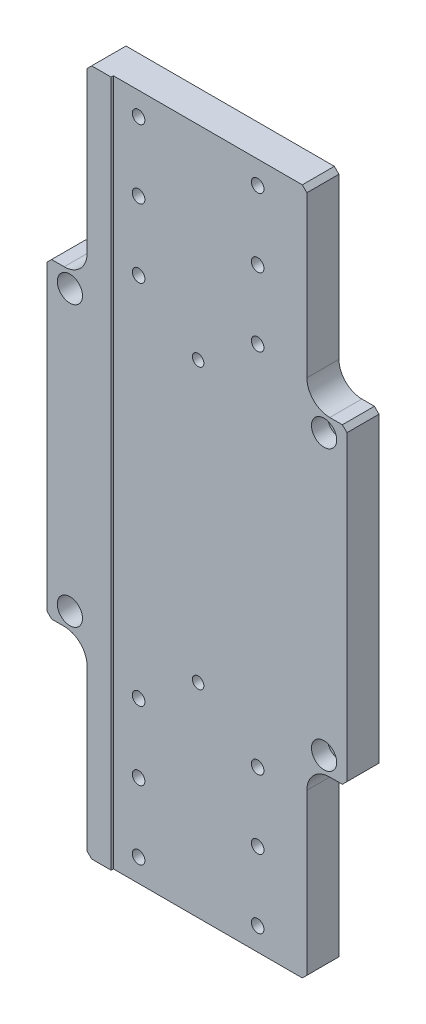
ISO-10303-21;
HEADER;
FILE_DESCRIPTION(('STEP AP214'),'2;1');
FILE_NAME('part.step','',(''),(''),'','','');
FILE_SCHEMA(('AUTOMOTIVE_DESIGN { 1 0 10303 214 1 1 1 1 }'));
ENDSEC;
DATA;
#1=APPLICATION_CONTEXT('core data for automotive mechanical design processes');
#2=APPLICATION_PROTOCOL_DEFINITION('international standard','automotive_design',2000,#1);
#3=PRODUCT_CONTEXT('',#1,'mechanical');
#4=PRODUCT('Part','Part','',(#3));
#5=PRODUCT_RELATED_PRODUCT_CATEGORY('part','',(#4));
#6=PRODUCT_DEFINITION_FORMATION('','',#4);
#7=PRODUCT_DEFINITION_CONTEXT('part definition',#1,'design');
#8=PRODUCT_DEFINITION('design','',#6,#7);
#9=PRODUCT_DEFINITION_SHAPE('','',#8);
#10=(LENGTH_UNIT() NAMED_UNIT(*) SI_UNIT(.MILLI.,.METRE.));
#11=(NAMED_UNIT(*) PLANE_ANGLE_UNIT() SI_UNIT($,.RADIAN.));
#12=(NAMED_UNIT(*) SI_UNIT($,.STERADIAN.) SOLID_ANGLE_UNIT());
#13=UNCERTAINTY_MEASURE_WITH_UNIT(LENGTH_MEASURE(1.E-05),#10,'distance_accuracy_value','');
#14=(GEOMETRIC_REPRESENTATION_CONTEXT(3) GLOBAL_UNCERTAINTY_ASSIGNED_CONTEXT((#13)) GLOBAL_UNIT_ASSIGNED_CONTEXT((#10,
#11,#12)) REPRESENTATION_CONTEXT('',''));
#15=CARTESIAN_POINT('',(0.,0.,0.));
#16=DIRECTION('',(0.,0.,1.));
#17=DIRECTION('',(1.,0.,0.));
#18=AXIS2_PLACEMENT_3D('',#15,#16,#17);
#19=CARTESIAN_POINT('',(47.5,150.,7.5));
#20=DIRECTION('',(1.,0.,0.));
#21=DIRECTION('',(0.,1.,0.));
#22=AXIS2_PLACEMENT_3D('',#19,#20,#21);
#23=PLANE('',#22);
#24=DIRECTION('',(0.,-1.,0.));
#25=VECTOR('',#24,1.);
#26=CARTESIAN_POINT('',(47.5,150.,6.5));
#27=LINE('',#26,#25);
#28=CARTESIAN_POINT('',(47.5,-78.,6.5));
#29=VERTEX_POINT('',#28);
#30=CARTESIAN_POINT('',(47.5,-148.,6.5));
#31=VERTEX_POINT('',#30);
#32=EDGE_CURVE('E268',#29,#31,#27,.T.);
#33=ORIENTED_EDGE('',*,*,#32,.T.);
#34=DIRECTION('',(0.,0.,-1.));
#35=VECTOR('',#34,1.);
#36=CARTESIAN_POINT('',(47.5,-148.,-7.5));
#37=LINE('',#36,#35);
#38=CARTESIAN_POINT('',(47.5,-148.,-7.5));
#39=VERTEX_POINT('',#38);
#40=EDGE_CURVE('E425',#31,#39,#37,.T.);
#41=ORIENTED_EDGE('',*,*,#40,.T.);
#42=DIRECTION('',(0.,-1.,0.));
#43=VECTOR('',#42,1.);
#44=CARTESIAN_POINT('',(47.5,150.,-7.5));
#45=LINE('',#44,#43);
#46=CARTESIAN_POINT('',(47.5,-78.,-7.5));
#47=VERTEX_POINT('',#46);
#48=EDGE_CURVE('E291',#47,#39,#45,.T.);
#49=ORIENTED_EDGE('',*,*,#48,.F.);
#50=DIRECTION('',(0.,0.,1.));
#51=VECTOR('',#50,1.);
#52=CARTESIAN_POINT('',(47.5,-78.,7.5));
#53=LINE('',#52,#51);
#54=EDGE_CURVE('E363',#47,#29,#53,.T.);
#55=ORIENTED_EDGE('',*,*,#54,.T.);
#56=EDGE_LOOP('',(#33,#41,#49,#55));
#57=FACE_BOUND('',#56,.T.);
#58=ADVANCED_FACE('F57',(#57),#23,.T.);
#59=CARTESIAN_POINT('',(47.5,148.,-7.5));
#60=VERTEX_POINT('',#59);
#61=CARTESIAN_POINT('',(47.5,78.,-7.5));
#62=VERTEX_POINT('',#61);
#63=EDGE_CURVE('E292',#60,#62,#45,.T.);
#64=ORIENTED_EDGE('',*,*,#63,.F.);
#65=DIRECTION('',(0.,0.,1.));
#66=VECTOR('',#65,1.);
#67=CARTESIAN_POINT('',(47.5,148.,7.5));
#68=LINE('',#67,#66);
#69=CARTESIAN_POINT('',(47.5,148.,6.5));
#70=VERTEX_POINT('',#69);
#71=EDGE_CURVE('E456',#60,#70,#68,.T.);
#72=ORIENTED_EDGE('',*,*,#71,.T.);
#73=DIRECTION('',(0.,-1.,0.));
#74=VECTOR('',#73,1.);
#75=CARTESIAN_POINT('',(47.5,150.,6.5));
#76=LINE('',#75,#74);
#77=CARTESIAN_POINT('',(47.5,78.,6.5));
#78=VERTEX_POINT('',#77);
#79=EDGE_CURVE('E275',#70,#78,#76,.T.);
#80=ORIENTED_EDGE('',*,*,#79,.T.);
#81=DIRECTION('',(0.,0.,1.));
#82=VECTOR('',#81,1.);
#83=CARTESIAN_POINT('',(47.5,78.,-7.5));
#84=LINE('',#83,#82);
#85=EDGE_CURVE('E371',#78,#62,#84,.F.);
#86=ORIENTED_EDGE('',*,*,#85,.T.);
#87=EDGE_LOOP('',(#64,#72,#80,#86));
#88=FACE_BOUND('',#87,.T.);
#89=ADVANCED_FACE('F526',(#88),#23,.T.);
#90=CARTESIAN_POINT('',(64.9999999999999,68.,7.5));
#91=DIRECTION('',(1.,0.,0.));
#92=DIRECTION('',(0.,1.,0.));
#93=AXIS2_PLACEMENT_3D('',#90,#91,#92);
#94=PLANE('',#93);
#95=DIRECTION('',(0.,1.,0.));
#96=VECTOR('',#95,1.);
#97=CARTESIAN_POINT('',(64.9999999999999,150.,6.5));
#98=LINE('',#97,#96);
#99=CARTESIAN_POINT('',(64.9999999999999,-66.,6.5));
#100=VERTEX_POINT('',#99);
#101=CARTESIAN_POINT('',(64.9999999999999,65.9999999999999,6.5));
#102=VERTEX_POINT('',#101);
#103=EDGE_CURVE('E259',#100,#102,#98,.T.);
#104=ORIENTED_EDGE('',*,*,#103,.F.);
#105=DIRECTION('',(0.,0.,-1.));
#106=VECTOR('',#105,1.);
#107=CARTESIAN_POINT('',(64.9999999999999,-66.,-7.5));
#108=LINE('',#107,#106);
#109=CARTESIAN_POINT('',(64.9999999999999,-66.,-7.5));
#110=VERTEX_POINT('',#109);
#111=EDGE_CURVE('E396',#100,#110,#108,.T.);
#112=ORIENTED_EDGE('',*,*,#111,.T.);
#113=DIRECTION('',(0.,-1.,0.));
#114=VECTOR('',#113,1.);
#115=CARTESIAN_POINT('',(64.9999999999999,68.,-7.5));
#116=LINE('',#115,#114);
#117=CARTESIAN_POINT('',(64.9999999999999,65.9999999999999,-7.5));
#118=VERTEX_POINT('',#117);
#119=EDGE_CURVE('E306',#118,#110,#116,.T.);
#120=ORIENTED_EDGE('',*,*,#119,.F.);
#121=DIRECTION('',(0.,0.,1.));
#122=VECTOR('',#121,1.);
#123=CARTESIAN_POINT('',(64.9999999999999,65.9999999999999,7.5));
#124=LINE('',#123,#122);
#125=EDGE_CURVE('E394',#118,#102,#124,.T.);
#126=ORIENTED_EDGE('',*,*,#125,.T.);
#127=EDGE_LOOP('',(#104,#112,#120,#126));
#128=FACE_BOUND('',#127,.T.);
#129=ADVANCED_FACE('F532',(#128),#94,.T.);
#130=CARTESIAN_POINT('',(-65.0000000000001,67.9999999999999,7.5));
#131=DIRECTION('',(0.,1.,0.));
#132=DIRECTION('',(-1.,0.,0.));
#133=AXIS2_PLACEMENT_3D('',#130,#131,#132);
#134=PLANE('',#133);
#135=DIRECTION('',(1.,0.,0.));
#136=VECTOR('',#135,1.);
#137=CARTESIAN_POINT('',(-65.0000000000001,67.9999999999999,6.5));
#138=LINE('',#137,#136);
#139=CARTESIAN_POINT('',(57.5,68.,6.5));
#140=VERTEX_POINT('',#139);
#141=CARTESIAN_POINT('',(62.9999999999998,68.,6.5));
#142=VERTEX_POINT('',#141);
#143=EDGE_CURVE('E272',#140,#142,#138,.T.);
#144=ORIENTED_EDGE('',*,*,#143,.T.);
#145=DIRECTION('',(0.,0.,-1.));
#146=VECTOR('',#145,1.);
#147=CARTESIAN_POINT('',(62.9999999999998,68.,7.5));
#148=LINE('',#147,#146);
#149=CARTESIAN_POINT('',(62.9999999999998,68.,-7.5));
#150=VERTEX_POINT('',#149);
#151=EDGE_CURVE('E448',#142,#150,#148,.T.);
#152=ORIENTED_EDGE('',*,*,#151,.T.);
#153=DIRECTION('',(1.,0.,0.));
#154=VECTOR('',#153,1.);
#155=CARTESIAN_POINT('',(-65.0000000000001,67.9999999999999,-7.5));
#156=LINE('',#155,#154);
#157=CARTESIAN_POINT('',(57.5,68.,-7.5));
#158=VERTEX_POINT('',#157);
#159=EDGE_CURVE('E277',#158,#150,#156,.T.);
#160=ORIENTED_EDGE('',*,*,#159,.F.);
#161=DIRECTION('',(0.,0.,1.));
#162=VECTOR('',#161,1.);
#163=CARTESIAN_POINT('',(57.5,68.,6.5));
#164=LINE('',#163,#162);
#165=EDGE_CURVE('E368',#158,#140,#164,.T.);
#166=ORIENTED_EDGE('',*,*,#165,.T.);
#167=EDGE_LOOP('',(#144,#152,#160,#166));
#168=FACE_BOUND('',#167,.T.);
#169=ADVANCED_FACE('F547',(#168),#134,.T.);
#170=CARTESIAN_POINT('',(-65.0000000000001,-68.0000000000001,7.5));
#171=DIRECTION('',(0.,1.,0.));
#172=DIRECTION('',(-1.,0.,0.));
#173=AXIS2_PLACEMENT_3D('',#170,#171,#172);
#174=PLANE('',#173);
#175=DIRECTION('',(1.,0.,0.));
#176=VECTOR('',#175,1.);
#177=CARTESIAN_POINT('',(-65.0000000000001,-68.0000000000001,-7.5));
#178=LINE('',#177,#176);
#179=CARTESIAN_POINT('',(57.5,-68.,-7.5));
#180=VERTEX_POINT('',#179);
#181=CARTESIAN_POINT('',(62.9999999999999,-68.,-7.5));
#182=VERTEX_POINT('',#181);
#183=EDGE_CURVE('E309',#180,#182,#178,.T.);
#184=ORIENTED_EDGE('',*,*,#183,.T.);
#185=DIRECTION('',(0.,0.,1.));
#186=VECTOR('',#185,1.);
#187=CARTESIAN_POINT('',(62.9999999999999,-68.,6.5));
#188=LINE('',#187,#186);
#189=CARTESIAN_POINT('',(62.9999999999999,-68.,6.5));
#190=VERTEX_POINT('',#189);
#191=EDGE_CURVE('E415',#182,#190,#188,.T.);
#192=ORIENTED_EDGE('',*,*,#191,.T.);
#193=DIRECTION('',(1.,0.,0.));
#194=VECTOR('',#193,1.);
#195=CARTESIAN_POINT('',(-65.0000000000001,-68.0000000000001,6.5));
#196=LINE('',#195,#194);
#197=CARTESIAN_POINT('',(57.5,-68.,6.5));
#198=VERTEX_POINT('',#197);
#199=EDGE_CURVE('E285',#198,#190,#196,.T.);
#200=ORIENTED_EDGE('',*,*,#199,.F.);
#201=DIRECTION('',(0.,0.,1.));
#202=VECTOR('',#201,1.);
#203=CARTESIAN_POINT('',(57.5,-68.,7.5));
#204=LINE('',#203,#202);
#205=EDGE_CURVE('E366',#198,#180,#204,.F.);
#206=ORIENTED_EDGE('',*,*,#205,.T.);
#207=EDGE_LOOP('',(#184,#192,#200,#206));
#208=FACE_BOUND('',#207,.T.);
#209=ADVANCED_FACE('F544',(#208),#174,.F.);
#210=CARTESIAN_POINT('',(-47.5,150.,7.5));
#211=DIRECTION('',(1.,0.,0.));
#212=DIRECTION('',(0.,1.,0.));
#213=AXIS2_PLACEMENT_3D('',#210,#211,#212);
#214=PLANE('',#213);
#215=DIRECTION('',(0.,-1.,0.));
#216=VECTOR('',#215,1.);
#217=CARTESIAN_POINT('',(-47.5,150.,-7.5));
#218=LINE('',#217,#216);
#219=CARTESIAN_POINT('',(-47.5,-78.,-7.5));
#220=VERTEX_POINT('',#219);
#221=CARTESIAN_POINT('',(-47.5,-148.,-7.5));
#222=VERTEX_POINT('',#221);
#223=EDGE_CURVE('E289',#220,#222,#218,.T.);
#224=ORIENTED_EDGE('',*,*,#223,.T.);
#225=DIRECTION('',(0.,0.,1.));
#226=VECTOR('',#225,1.);
#227=CARTESIAN_POINT('',(-47.5,-148.,7.5));
#228=LINE('',#227,#226);
#229=CARTESIAN_POINT('',(-47.5,-148.,7.5));
#230=VERTEX_POINT('',#229);
#231=EDGE_CURVE('E432',#222,#230,#228,.T.);
#232=ORIENTED_EDGE('',*,*,#231,.T.);
#233=DIRECTION('',(0.,-1.,0.));
#234=VECTOR('',#233,1.);
#235=CARTESIAN_POINT('',(-47.5,150.,7.5));
#236=LINE('',#235,#234);
#237=CARTESIAN_POINT('',(-47.5,-78.,7.5));
#238=VERTEX_POINT('',#237);
#239=EDGE_CURVE('E281',#238,#230,#236,.T.);
#240=ORIENTED_EDGE('',*,*,#239,.F.);
#241=DIRECTION('',(0.,0.,1.));
#242=VECTOR('',#241,1.);
#243=CARTESIAN_POINT('',(-47.5,-78.0000000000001,-7.5));
#244=LINE('',#243,#242);
#245=EDGE_CURVE('E361',#238,#220,#244,.F.);
#246=ORIENTED_EDGE('',*,*,#245,.T.);
#247=EDGE_LOOP('',(#224,#232,#240,#246));
#248=FACE_BOUND('',#247,.T.);
#249=ADVANCED_FACE('F490',(#248),#214,.F.);
#250=CARTESIAN_POINT('',(-47.5,-150.,7.5));
#251=DIRECTION('',(0.,1.,0.));
#252=DIRECTION('',(-1.,0.,0.));
#253=AXIS2_PLACEMENT_3D('',#250,#251,#252);
#254=PLANE('',#253);
#255=DIRECTION('',(1.,0.,0.));
#256=VECTOR('',#255,1.);
#257=CARTESIAN_POINT('',(-47.5,-150.,-7.5));
#258=LINE('',#257,#256);
#259=CARTESIAN_POINT('',(-45.5000000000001,-150.,-7.5));
#260=VERTEX_POINT('',#259);
#261=CARTESIAN_POINT('',(45.5,-150.,-7.5));
#262=VERTEX_POINT('',#261);
#263=EDGE_CURVE('E288',#260,#262,#258,.T.);
#264=ORIENTED_EDGE('',*,*,#263,.T.);
#265=DIRECTION('',(0.,0.,1.));
#266=VECTOR('',#265,1.);
#267=CARTESIAN_POINT('',(45.5,-150.,6.5));
#268=LINE('',#267,#266);
#269=CARTESIAN_POINT('',(45.5,-150.,6.5));
#270=VERTEX_POINT('',#269);
#271=EDGE_CURVE('E258',#262,#270,#268,.T.);
#272=ORIENTED_EDGE('',*,*,#271,.T.);
#273=DIRECTION('',(1.,0.,0.));
#274=VECTOR('',#273,1.);
#275=CARTESIAN_POINT('',(-37.0000000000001,-150.,6.5));
#276=LINE('',#275,#274);
#277=CARTESIAN_POINT('',(-37.0000000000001,-150.,6.5));
#278=VERTEX_POINT('',#277);
#279=EDGE_CURVE('E251',#278,#270,#276,.T.);
#280=ORIENTED_EDGE('',*,*,#279,.F.);
#281=DIRECTION('',(0.,0.,1.));
#282=VECTOR('',#281,1.);
#283=CARTESIAN_POINT('',(-37.0000000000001,-150.,6.5));
#284=LINE('',#283,#282);
#285=CARTESIAN_POINT('',(-37.0000000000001,-150.,7.5));
#286=VERTEX_POINT('',#285);
#287=EDGE_CURVE('E233',#278,#286,#284,.T.);
#288=ORIENTED_EDGE('',*,*,#287,.T.);
#289=DIRECTION('',(1.,0.,0.));
#290=VECTOR('',#289,1.);
#291=CARTESIAN_POINT('',(-47.5,-150.,7.5));
#292=LINE('',#291,#290);
#293=CARTESIAN_POINT('',(-45.5000000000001,-150.,7.5));
#294=VERTEX_POINT('',#293);
#295=EDGE_CURVE('E280',#294,#286,#292,.T.);
#296=ORIENTED_EDGE('',*,*,#295,.F.);
#297=DIRECTION('',(0.,0.,-1.));
#298=VECTOR('',#297,1.);
#299=CARTESIAN_POINT('',(-45.5000000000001,-150.,7.5));
#300=LINE('',#299,#298);
#301=EDGE_CURVE('E428',#294,#260,#300,.T.);
#302=ORIENTED_EDGE('',*,*,#301,.T.);
#303=EDGE_LOOP('',(#264,#272,#280,#288,#296,#302));
#304=FACE_BOUND('',#303,.T.);
#305=ADVANCED_FACE('F256',(#304),#254,.F.);
#306=CARTESIAN_POINT('',(-47.5,150.,7.5));
#307=DIRECTION('',(0.,1.,0.));
#308=DIRECTION('',(0.,0.,1.));
#309=AXIS2_PLACEMENT_3D('',#306,#307,#308);
#310=PLANE('',#309);
#311=DIRECTION('',(-1.,0.,0.));
#312=VECTOR('',#311,1.);
#313=CARTESIAN_POINT('',(-37.0000000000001,150.,6.5));
#314=LINE('',#313,#312);
#315=CARTESIAN_POINT('',(45.5,150.,6.5));
#316=VERTEX_POINT('',#315);
#317=CARTESIAN_POINT('',(-37.0000000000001,150.,6.5));
#318=VERTEX_POINT('',#317);
#319=EDGE_CURVE('E245',#316,#318,#314,.T.);
#320=ORIENTED_EDGE('',*,*,#319,.F.);
#321=DIRECTION('',(0.,0.,-1.));
#322=VECTOR('',#321,1.);
#323=CARTESIAN_POINT('',(45.5,150.,7.5));
#324=LINE('',#323,#322);
#325=CARTESIAN_POINT('',(45.5,150.,-7.5));
#326=VERTEX_POINT('',#325);
#327=EDGE_CURVE('E453',#316,#326,#324,.T.);
#328=ORIENTED_EDGE('',*,*,#327,.T.);
#329=DIRECTION('',(1.,0.,0.));
#330=VECTOR('',#329,1.);
#331=CARTESIAN_POINT('',(-47.5,150.,-7.5));
#332=LINE('',#331,#330);
#333=CARTESIAN_POINT('',(-45.5,150.,-7.5));
#334=VERTEX_POINT('',#333);
#335=EDGE_CURVE('E294',#334,#326,#332,.T.);
#336=ORIENTED_EDGE('',*,*,#335,.F.);
#337=DIRECTION('',(0.,0.,1.));
#338=VECTOR('',#337,1.);
#339=CARTESIAN_POINT('',(-45.5,150.,7.5));
#340=LINE('',#339,#338);
#341=CARTESIAN_POINT('',(-45.5,150.,7.5));
#342=VERTEX_POINT('',#341);
#343=EDGE_CURVE('E451',#334,#342,#340,.T.);
#344=ORIENTED_EDGE('',*,*,#343,.T.);
#345=DIRECTION('',(1.,0.,0.));
#346=VECTOR('',#345,1.);
#347=CARTESIAN_POINT('',(-47.5,150.,7.5));
#348=LINE('',#347,#346);
#349=CARTESIAN_POINT('',(-37.0000000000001,150.,7.5));
#350=VERTEX_POINT('',#349);
#351=EDGE_CURVE('E283',#342,#350,#348,.T.);
#352=ORIENTED_EDGE('',*,*,#351,.T.);
#353=DIRECTION('',(0.,0.,1.));
#354=VECTOR('',#353,1.);
#355=CARTESIAN_POINT('',(-37.0000000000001,150.,6.5));
#356=LINE('',#355,#354);
#357=EDGE_CURVE('E244',#318,#350,#356,.T.);
#358=ORIENTED_EDGE('',*,*,#357,.F.);
#359=EDGE_LOOP('',(#320,#328,#336,#344,#352,#358));
#360=FACE_BOUND('',#359,.T.);
#361=ADVANCED_FACE('F536',(#360),#310,.T.);
#362=CARTESIAN_POINT('',(-47.5,148.,7.5));
#363=VERTEX_POINT('',#362);
#364=CARTESIAN_POINT('',(-47.5,77.9999999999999,7.5));
#365=VERTEX_POINT('',#364);
#366=EDGE_CURVE('E278',#363,#365,#236,.T.);
#367=ORIENTED_EDGE('',*,*,#366,.F.);
#368=DIRECTION('',(0.,0.,-1.));
#369=VECTOR('',#368,1.);
#370=CARTESIAN_POINT('',(-47.5,148.,-7.5));
#371=LINE('',#370,#369);
#372=CARTESIAN_POINT('',(-47.5,148.,-7.5));
#373=VERTEX_POINT('',#372);
#374=EDGE_CURVE('E12',#363,#373,#371,.T.);
#375=ORIENTED_EDGE('',*,*,#374,.T.);
#376=CARTESIAN_POINT('',(-47.5,77.9999999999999,-7.5));
#377=VERTEX_POINT('',#376);
#378=EDGE_CURVE('E286',#373,#377,#218,.T.);
#379=ORIENTED_EDGE('',*,*,#378,.T.);
#380=DIRECTION('',(0.,0.,1.));
#381=VECTOR('',#380,1.);
#382=CARTESIAN_POINT('',(-47.5,77.9999999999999,7.5));
#383=LINE('',#382,#381);
#384=EDGE_CURVE('E314',#377,#365,#383,.T.);
#385=ORIENTED_EDGE('',*,*,#384,.T.);
#386=EDGE_LOOP('',(#367,#375,#379,#385));
#387=FACE_BOUND('',#386,.T.);
#388=ADVANCED_FACE('F506',(#387),#214,.F.);
#389=CARTESIAN_POINT('',(0.,0.,-7.5));
#390=DIRECTION('',(0.,0.,1.));
#391=DIRECTION('',(1.,0.,0.));
#392=AXIS2_PLACEMENT_3D('',#389,#390,#391);
#393=PLANE('',#392);
#394=CARTESIAN_POINT('',(0.,61.0000000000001,-7.5));
#395=DIRECTION('',(0.,0.,1.));
#396=DIRECTION('',(1.,0.,0.));
#397=AXIS2_PLACEMENT_3D('',#394,#395,#396);
#398=CIRCLE('',#397,2.5);
#399=CARTESIAN_POINT('',(2.5,61.0000000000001,-7.5));
#400=VERTEX_POINT('',#399);
#401=EDGE_CURVE('E580',#400,#400,#398,.T.);
#402=ORIENTED_EDGE('',*,*,#401,.T.);
#403=EDGE_LOOP('',(#402));
#404=FACE_BOUND('',#403,.T.);
#405=CARTESIAN_POINT('',(0.,-60.9999999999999,-7.5));
#406=DIRECTION('',(0.,0.,1.));
#407=DIRECTION('',(1.,0.,0.));
#408=AXIS2_PLACEMENT_3D('',#405,#406,#407);
#409=CIRCLE('',#408,2.5);
#410=CARTESIAN_POINT('',(2.5,-60.9999999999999,-7.5));
#411=VERTEX_POINT('',#410);
#412=EDGE_CURVE('E584',#411,#411,#409,.T.);
#413=ORIENTED_EDGE('',*,*,#412,.T.);
#414=EDGE_LOOP('',(#413));
#415=FACE_BOUND('',#414,.T.);
#416=CARTESIAN_POINT('',(-26.,-80.,-7.5));
#417=DIRECTION('',(0.,0.,-1.));
#418=DIRECTION('',(-1.,0.,0.));
#419=AXIS2_PLACEMENT_3D('',#416,#417,#418);
#420=CIRCLE('',#419,4.75);
#421=CARTESIAN_POINT('',(-30.75,-80.,-7.5));
#422=VERTEX_POINT('',#421);
#423=EDGE_CURVE('E588',#422,#422,#420,.T.);
#424=ORIENTED_EDGE('',*,*,#423,.F.);
#425=EDGE_LOOP('',(#424));
#426=FACE_BOUND('',#425,.T.);
#427=CARTESIAN_POINT('',(26.,-110.,-7.5));
#428=DIRECTION('',(0.,0.,-1.));
#429=DIRECTION('',(-1.,0.,0.));
#430=AXIS2_PLACEMENT_3D('',#427,#428,#429);
#431=CIRCLE('',#430,4.75);
#432=CARTESIAN_POINT('',(21.25,-110.,-7.5));
#433=VERTEX_POINT('',#432);
#434=EDGE_CURVE('E592',#433,#433,#431,.T.);
#435=ORIENTED_EDGE('',*,*,#434,.F.);
#436=EDGE_LOOP('',(#435));
#437=FACE_BOUND('',#436,.T.);
#438=CARTESIAN_POINT('',(-26.,-110.,-7.5));
#439=DIRECTION('',(0.,0.,-1.));
#440=DIRECTION('',(-1.,0.,0.));
#441=AXIS2_PLACEMENT_3D('',#438,#439,#440);
#442=CIRCLE('',#441,4.75);
#443=CARTESIAN_POINT('',(-30.75,-110.,-7.5));
#444=VERTEX_POINT('',#443);
#445=EDGE_CURVE('E596',#444,#444,#442,.T.);
#446=ORIENTED_EDGE('',*,*,#445,.F.);
#447=EDGE_LOOP('',(#446));
#448=FACE_BOUND('',#447,.T.);
#449=CARTESIAN_POINT('',(26.,-140.,-7.5));
#450=DIRECTION('',(0.,0.,-1.));
#451=DIRECTION('',(-1.,0.,0.));
#452=AXIS2_PLACEMENT_3D('',#449,#450,#451);
#453=CIRCLE('',#452,4.75);
#454=CARTESIAN_POINT('',(21.25,-140.,-7.5));
#455=VERTEX_POINT('',#454);
#456=EDGE_CURVE('E600',#455,#455,#453,.T.);
#457=ORIENTED_EDGE('',*,*,#456,.F.);
#458=EDGE_LOOP('',(#457));
#459=FACE_BOUND('',#458,.T.);
#460=CARTESIAN_POINT('',(-26.,-140.,-7.5));
#461=DIRECTION('',(0.,0.,-1.));
#462=DIRECTION('',(-1.,0.,0.));
#463=AXIS2_PLACEMENT_3D('',#460,#461,#462);
#464=CIRCLE('',#463,4.75);
#465=CARTESIAN_POINT('',(-30.75,-140.,-7.5));
#466=VERTEX_POINT('',#465);
#467=EDGE_CURVE('E604',#466,#466,#464,.T.);
#468=ORIENTED_EDGE('',*,*,#467,.F.);
#469=EDGE_LOOP('',(#468));
#470=FACE_BOUND('',#469,.T.);
#471=CARTESIAN_POINT('',(26.,-80.,-7.5));
#472=DIRECTION('',(0.,0.,-1.));
#473=DIRECTION('',(-1.,0.,0.));
#474=AXIS2_PLACEMENT_3D('',#471,#472,#473);
#475=CIRCLE('',#474,4.75);
#476=CARTESIAN_POINT('',(21.25,-80.,-7.5));
#477=VERTEX_POINT('',#476);
#478=EDGE_CURVE('E608',#477,#477,#475,.T.);
#479=ORIENTED_EDGE('',*,*,#478,.F.);
#480=EDGE_LOOP('',(#479));
#481=FACE_BOUND('',#480,.T.);
#482=CARTESIAN_POINT('',(26.,140.,-7.5));
#483=DIRECTION('',(0.,0.,-1.));
#484=DIRECTION('',(-1.,0.,0.));
#485=AXIS2_PLACEMENT_3D('',#482,#483,#484);
#486=CIRCLE('',#485,4.75);
#487=CARTESIAN_POINT('',(21.25,140.,-7.5));
#488=VERTEX_POINT('',#487);
#489=EDGE_CURVE('E612',#488,#488,#486,.T.);
#490=ORIENTED_EDGE('',*,*,#489,.F.);
#491=EDGE_LOOP('',(#490));
#492=FACE_BOUND('',#491,.T.);
#493=CARTESIAN_POINT('',(-26.,140.,-7.5));
#494=DIRECTION('',(0.,0.,-1.));
#495=DIRECTION('',(-1.,0.,0.));
#496=AXIS2_PLACEMENT_3D('',#493,#494,#495);
#497=CIRCLE('',#496,4.75);
#498=CARTESIAN_POINT('',(-30.75,140.,-7.5));
#499=VERTEX_POINT('',#498);
#500=EDGE_CURVE('E351',#499,#499,#497,.T.);
#501=ORIENTED_EDGE('',*,*,#500,.F.);
#502=EDGE_LOOP('',(#501));
#503=FACE_BOUND('',#502,.T.);
#504=CARTESIAN_POINT('',(26.,110.,-7.5));
#505=DIRECTION('',(0.,0.,-1.));
#506=DIRECTION('',(-1.,0.,0.));
#507=AXIS2_PLACEMENT_3D('',#504,#505,#506);
#508=CIRCLE('',#507,4.75);
#509=CARTESIAN_POINT('',(21.25,110.,-7.5));
#510=VERTEX_POINT('',#509);
#511=EDGE_CURVE('E346',#510,#510,#508,.T.);
#512=ORIENTED_EDGE('',*,*,#511,.F.);
#513=EDGE_LOOP('',(#512));
#514=FACE_BOUND('',#513,.T.);
#515=CARTESIAN_POINT('',(-26.,110.,-7.5));
#516=DIRECTION('',(0.,0.,-1.));
#517=DIRECTION('',(-1.,0.,0.));
#518=AXIS2_PLACEMENT_3D('',#515,#516,#517);
#519=CIRCLE('',#518,4.75);
#520=CARTESIAN_POINT('',(-30.75,110.,-7.5));
#521=VERTEX_POINT('',#520);
#522=EDGE_CURVE('E341',#521,#521,#519,.T.);
#523=ORIENTED_EDGE('',*,*,#522,.F.);
#524=EDGE_LOOP('',(#523));
#525=FACE_BOUND('',#524,.T.);
#526=CARTESIAN_POINT('',(26.,80.,-7.5));
#527=DIRECTION('',(0.,0.,-1.));
#528=DIRECTION('',(-1.,0.,0.));
#529=AXIS2_PLACEMENT_3D('',#526,#527,#528);
#530=CIRCLE('',#529,4.75);
#531=CARTESIAN_POINT('',(21.25,80.,-7.5));
#532=VERTEX_POINT('',#531);
#533=EDGE_CURVE('E336',#532,#532,#530,.T.);
#534=ORIENTED_EDGE('',*,*,#533,.F.);
#535=EDGE_LOOP('',(#534));
#536=FACE_BOUND('',#535,.T.);
#537=CARTESIAN_POINT('',(-26.,80.,-7.5));
#538=DIRECTION('',(0.,0.,-1.));
#539=DIRECTION('',(-1.,0.,0.));
#540=AXIS2_PLACEMENT_3D('',#537,#538,#539);
#541=CIRCLE('',#540,4.75);
#542=CARTESIAN_POINT('',(-30.75,80.,-7.5));
#543=VERTEX_POINT('',#542);
#544=EDGE_CURVE('E331',#543,#543,#541,.T.);
#545=ORIENTED_EDGE('',*,*,#544,.F.);
#546=EDGE_LOOP('',(#545));
#547=FACE_BOUND('',#546,.T.);
#548=CARTESIAN_POINT('',(-55.0000000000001,61.0000000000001,-7.5));
#549=DIRECTION('',(0.,0.,1.));
#550=DIRECTION('',(1.,0.,0.));
#551=AXIS2_PLACEMENT_3D('',#548,#549,#550);
#552=CIRCLE('',#551,3.3);
#553=CARTESIAN_POINT('',(-51.7000000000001,61.0000000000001,-7.5));
#554=VERTEX_POINT('',#553);
#555=EDGE_CURVE('E631',#554,#554,#552,.T.);
#556=ORIENTED_EDGE('',*,*,#555,.T.);
#557=EDGE_LOOP('',(#556));
#558=FACE_BOUND('',#557,.T.);
#559=CARTESIAN_POINT('',(54.9999999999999,61.0000000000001,-7.5));
#560=DIRECTION('',(0.,0.,1.));
#561=DIRECTION('',(1.,0.,0.));
#562=AXIS2_PLACEMENT_3D('',#559,#560,#561);
#563=CIRCLE('',#562,3.3);
#564=CARTESIAN_POINT('',(58.2999999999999,61.0000000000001,-7.5));
#565=VERTEX_POINT('',#564);
#566=EDGE_CURVE('E322',#565,#565,#563,.T.);
#567=ORIENTED_EDGE('',*,*,#566,.T.);
#568=EDGE_LOOP('',(#567));
#569=FACE_BOUND('',#568,.T.);
#570=CARTESIAN_POINT('',(-55.,-60.9999999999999,-7.5));
#571=DIRECTION('',(0.,0.,1.));
#572=DIRECTION('',(1.,0.,0.));
#573=AXIS2_PLACEMENT_3D('',#570,#571,#572);
#574=CIRCLE('',#573,3.3);
#575=CARTESIAN_POINT('',(-51.7000000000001,-60.9999999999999,-7.5));
#576=VERTEX_POINT('',#575);
#577=EDGE_CURVE('E638',#576,#576,#574,.T.);
#578=ORIENTED_EDGE('',*,*,#577,.T.);
#579=EDGE_LOOP('',(#578));
#580=FACE_BOUND('',#579,.T.);
#581=CARTESIAN_POINT('',(54.9999999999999,-60.9999999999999,-7.5));
#582=DIRECTION('',(0.,0.,1.));
#583=DIRECTION('',(1.,0.,0.));
#584=AXIS2_PLACEMENT_3D('',#581,#582,#583);
#585=CIRCLE('',#584,3.3);
#586=CARTESIAN_POINT('',(58.2999999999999,-60.9999999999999,-7.5));
#587=VERTEX_POINT('',#586);
#588=EDGE_CURVE('E317',#587,#587,#585,.T.);
#589=ORIENTED_EDGE('',*,*,#588,.T.);
#590=EDGE_LOOP('',(#589));
#591=FACE_BOUND('',#590,.T.);
#592=ORIENTED_EDGE('',*,*,#119,.T.);
#593=DIRECTION('',(-0.707106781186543,-0.707106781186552,0.));
#594=VECTOR('',#593,1.);
#595=CARTESIAN_POINT('',(64.9999999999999,-66.,-7.5));
#596=LINE('',#595,#594);
#597=EDGE_CURVE('E413',#110,#182,#596,.T.);
#598=ORIENTED_EDGE('',*,*,#597,.T.);
#599=ORIENTED_EDGE('',*,*,#183,.F.);
#600=CARTESIAN_POINT('',(57.5,-78.,-7.5));
#601=DIRECTION('',(0.,0.,1.));
#602=DIRECTION('',(1.,0.,0.));
#603=AXIS2_PLACEMENT_3D('',#600,#601,#602);
#604=CIRCLE('',#603,10.);
#605=EDGE_CURVE('E387',#180,#47,#604,.T.);
#606=ORIENTED_EDGE('',*,*,#605,.T.);
#607=ORIENTED_EDGE('',*,*,#48,.T.);
#608=DIRECTION('',(-0.707106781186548,-0.707106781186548,0.));
#609=VECTOR('',#608,1.);
#610=CARTESIAN_POINT('',(47.5,-148.,-7.5));
#611=LINE('',#610,#609);
#612=EDGE_CURVE('E411',#39,#262,#611,.T.);
#613=ORIENTED_EDGE('',*,*,#612,.T.);
#614=ORIENTED_EDGE('',*,*,#263,.F.);
#615=DIRECTION('',(0.707106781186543,-0.707106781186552,0.));
#616=VECTOR('',#615,1.);
#617=CARTESIAN_POINT('',(-45.5000000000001,-150.,-7.5));
#618=LINE('',#617,#616);
#619=EDGE_CURVE('E409',#260,#222,#618,.F.);
#620=ORIENTED_EDGE('',*,*,#619,.T.);
#621=ORIENTED_EDGE('',*,*,#223,.F.);
#622=CARTESIAN_POINT('',(-57.5,-78.0000000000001,-7.5));
#623=DIRECTION('',(0.,0.,1.));
#624=DIRECTION('',(1.,0.,0.));
#625=AXIS2_PLACEMENT_3D('',#622,#623,#624);
#626=CIRCLE('',#625,10.);
#627=CARTESIAN_POINT('',(-57.5,-68.0000000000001,-7.5));
#628=VERTEX_POINT('',#627);
#629=EDGE_CURVE('E382',#220,#628,#626,.T.);
#630=ORIENTED_EDGE('',*,*,#629,.T.);
#631=CARTESIAN_POINT('',(-63.,-68.0000000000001,-7.5));
#632=VERTEX_POINT('',#631);
#633=EDGE_CURVE('E310',#632,#628,#178,.T.);
#634=ORIENTED_EDGE('',*,*,#633,.F.);
#635=DIRECTION('',(0.707106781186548,-0.707106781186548,0.));
#636=VECTOR('',#635,1.);
#637=CARTESIAN_POINT('',(-63.,-68.0000000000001,-7.5));
#638=LINE('',#637,#636);
#639=CARTESIAN_POINT('',(-65.0000000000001,-66.,-7.5));
#640=VERTEX_POINT('',#639);
#641=EDGE_CURVE('E407',#632,#640,#638,.F.);
#642=ORIENTED_EDGE('',*,*,#641,.T.);
#643=DIRECTION('',(0.,-1.,0.));
#644=VECTOR('',#643,1.);
#645=CARTESIAN_POINT('',(-65.0000000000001,67.9999999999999,-7.5));
#646=LINE('',#645,#644);
#647=CARTESIAN_POINT('',(-65.0000000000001,65.9999999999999,-7.5));
#648=VERTEX_POINT('',#647);
#649=EDGE_CURVE('E300',#648,#640,#646,.T.);
#650=ORIENTED_EDGE('',*,*,#649,.F.);
#651=DIRECTION('',(0.707106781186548,0.707106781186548,0.));
#652=VECTOR('',#651,1.);
#653=CARTESIAN_POINT('',(-65.0000000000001,65.9999999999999,-7.5));
#654=LINE('',#653,#652);
#655=CARTESIAN_POINT('',(-63.,67.9999999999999,-7.5));
#656=VERTEX_POINT('',#655);
#657=EDGE_CURVE('E401',#648,#656,#654,.T.);
#658=ORIENTED_EDGE('',*,*,#657,.T.);
#659=CARTESIAN_POINT('',(-57.5,67.9999999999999,-7.5));
#660=VERTEX_POINT('',#659);
#661=EDGE_CURVE('E304',#656,#660,#156,.T.);
#662=ORIENTED_EDGE('',*,*,#661,.T.);
#663=CARTESIAN_POINT('',(-57.5,77.9999999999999,-7.5));
#664=DIRECTION('',(0.,0.,1.));
#665=DIRECTION('',(1.,0.,0.));
#666=AXIS2_PLACEMENT_3D('',#663,#664,#665);
#667=CIRCLE('',#666,10.);
#668=EDGE_CURVE('E377',#660,#377,#667,.T.);
#669=ORIENTED_EDGE('',*,*,#668,.T.);
#670=ORIENTED_EDGE('',*,*,#378,.F.);
#671=DIRECTION('',(0.707106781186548,0.707106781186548,0.));
#672=VECTOR('',#671,1.);
#673=CARTESIAN_POINT('',(-47.5,148.,-7.5));
#674=LINE('',#673,#672);
#675=EDGE_CURVE('E399',#373,#334,#674,.T.);
#676=ORIENTED_EDGE('',*,*,#675,.T.);
#677=ORIENTED_EDGE('',*,*,#335,.T.);
#678=DIRECTION('',(-0.707106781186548,0.707106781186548,0.));
#679=VECTOR('',#678,1.);
#680=CARTESIAN_POINT('',(45.5,150.,-7.5));
#681=LINE('',#680,#679);
#682=EDGE_CURVE('E403',#326,#60,#681,.F.);
#683=ORIENTED_EDGE('',*,*,#682,.T.);
#684=ORIENTED_EDGE('',*,*,#63,.T.);
#685=CARTESIAN_POINT('',(57.5,78.,-7.5));
#686=DIRECTION('',(0.,0.,1.));
#687=DIRECTION('',(1.,0.,0.));
#688=AXIS2_PLACEMENT_3D('',#685,#686,#687);
#689=CIRCLE('',#688,10.);
#690=EDGE_CURVE('E392',#62,#158,#689,.T.);
#691=ORIENTED_EDGE('',*,*,#690,.T.);
#692=ORIENTED_EDGE('',*,*,#159,.T.);
#693=DIRECTION('',(-0.707106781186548,0.707106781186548,0.));
#694=VECTOR('',#693,1.);
#695=CARTESIAN_POINT('',(62.9999999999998,68.,-7.5));
#696=LINE('',#695,#694);
#697=EDGE_CURVE('E405',#150,#118,#696,.F.);
#698=ORIENTED_EDGE('',*,*,#697,.T.);
#699=EDGE_LOOP('',(#592,#598,#599,#606,#607,#613,#614,#620,#621,#630,#634,#642,#650,#658,#662,
#669,#670,#676,#677,#683,#684,#691,#692,#698));
#700=FACE_BOUND('',#699,.T.);
#701=ADVANCED_FACE('F473',(#404,#415,#426,#437,#448,#459,#470,#481,#492,#503,#514,#525,#536,
#547,#558,#569,#580,#591,#700),#393,.F.);
#702=CARTESIAN_POINT('',(0.,0.,7.5));
#703=DIRECTION('',(0.,0.,1.));
#704=DIRECTION('',(1.,0.,0.));
#705=AXIS2_PLACEMENT_3D('',#702,#703,#704);
#706=PLANE('',#705);
#707=CARTESIAN_POINT('',(-55.0000000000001,61.0000000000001,7.5));
#708=DIRECTION('',(0.,0.,1.));
#709=DIRECTION('',(1.,0.,0.));
#710=AXIS2_PLACEMENT_3D('',#707,#708,#709);
#711=CIRCLE('',#710,5.5);
#712=CARTESIAN_POINT('',(-49.5000000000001,61.0000000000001,7.5));
#713=VERTEX_POINT('',#712);
#714=EDGE_CURVE('E326',#713,#713,#711,.T.);
#715=ORIENTED_EDGE('',*,*,#714,.F.);
#716=EDGE_LOOP('',(#715));
#717=FACE_BOUND('',#716,.T.);
#718=CARTESIAN_POINT('',(-55.,-60.9999999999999,7.5));
#719=DIRECTION('',(0.,0.,1.));
#720=DIRECTION('',(1.,0.,0.));
#721=AXIS2_PLACEMENT_3D('',#718,#719,#720);
#722=CIRCLE('',#721,5.5);
#723=CARTESIAN_POINT('',(-49.5,-60.9999999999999,7.5));
#724=VERTEX_POINT('',#723);
#725=EDGE_CURVE('E321',#724,#724,#722,.T.);
#726=ORIENTED_EDGE('',*,*,#725,.F.);
#727=EDGE_LOOP('',(#726));
#728=FACE_BOUND('',#727,.T.);
#729=ORIENTED_EDGE('',*,*,#239,.T.);
#730=DIRECTION('',(-0.707106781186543,0.707106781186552,0.));
#731=VECTOR('',#730,1.);
#732=CARTESIAN_POINT('',(-97.7500000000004,-97.749999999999,7.5));
#733=LINE('',#732,#731);
#734=EDGE_CURVE('E439',#230,#294,#733,.F.);
#735=ORIENTED_EDGE('',*,*,#734,.T.);
#736=ORIENTED_EDGE('',*,*,#295,.T.);
#737=DIRECTION('',(0.,-1.,0.));
#738=VECTOR('',#737,1.);
#739=CARTESIAN_POINT('',(-37.0000000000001,150.,7.5));
#740=LINE('',#739,#738);
#741=EDGE_CURVE('E240',#350,#286,#740,.T.);
#742=ORIENTED_EDGE('',*,*,#741,.F.);
#743=ORIENTED_EDGE('',*,*,#351,.F.);
#744=DIRECTION('',(-0.707106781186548,-0.707106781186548,0.));
#745=VECTOR('',#744,1.);
#746=CARTESIAN_POINT('',(-97.75,97.75,7.5));
#747=LINE('',#746,#745);
#748=EDGE_CURVE('E434',#342,#363,#747,.T.);
#749=ORIENTED_EDGE('',*,*,#748,.T.);
#750=ORIENTED_EDGE('',*,*,#366,.T.);
#751=CARTESIAN_POINT('',(-57.5,77.9999999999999,7.5));
#752=DIRECTION('',(0.,0.,1.));
#753=DIRECTION('',(1.,0.,0.));
#754=AXIS2_PLACEMENT_3D('',#751,#752,#753);
#755=CIRCLE('',#754,10.);
#756=CARTESIAN_POINT('',(-57.5,67.9999999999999,7.5));
#757=VERTEX_POINT('',#756);
#758=EDGE_CURVE('E374',#365,#757,#755,.F.);
#759=ORIENTED_EDGE('',*,*,#758,.T.);
#760=DIRECTION('',(1.,0.,0.));
#761=VECTOR('',#760,1.);
#762=CARTESIAN_POINT('',(-65.0000000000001,67.9999999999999,7.5));
#763=LINE('',#762,#761);
#764=CARTESIAN_POINT('',(-63.,67.9999999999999,7.5));
#765=VERTEX_POINT('',#764);
#766=EDGE_CURVE('E297',#765,#757,#763,.T.);
#767=ORIENTED_EDGE('',*,*,#766,.F.);
#768=DIRECTION('',(-0.707106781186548,-0.707106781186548,0.));
#769=VECTOR('',#768,1.);
#770=CARTESIAN_POINT('',(-65.5,65.5,7.5));
#771=LINE('',#770,#769);
#772=CARTESIAN_POINT('',(-65.0000000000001,65.9999999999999,7.5));
#773=VERTEX_POINT('',#772);
#774=EDGE_CURVE('E436',#765,#773,#771,.T.);
#775=ORIENTED_EDGE('',*,*,#774,.T.);
#776=DIRECTION('',(0.,-1.,0.));
#777=VECTOR('',#776,1.);
#778=CARTESIAN_POINT('',(-65.0000000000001,67.9999999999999,7.5));
#779=LINE('',#778,#777);
#780=CARTESIAN_POINT('',(-65.0000000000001,-66.,7.5));
#781=VERTEX_POINT('',#780);
#782=EDGE_CURVE('E302',#773,#781,#779,.T.);
#783=ORIENTED_EDGE('',*,*,#782,.T.);
#784=DIRECTION('',(-0.707106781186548,0.707106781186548,0.));
#785=VECTOR('',#784,1.);
#786=CARTESIAN_POINT('',(-65.5,-65.5,7.5));
#787=LINE('',#786,#785);
#788=CARTESIAN_POINT('',(-63.,-68.0000000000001,7.5));
#789=VERTEX_POINT('',#788);
#790=EDGE_CURVE('E72',#781,#789,#787,.F.);
#791=ORIENTED_EDGE('',*,*,#790,.T.);
#792=DIRECTION('',(1.,0.,0.));
#793=VECTOR('',#792,1.);
#794=CARTESIAN_POINT('',(-65.0000000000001,-68.0000000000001,7.5));
#795=LINE('',#794,#793);
#796=CARTESIAN_POINT('',(-57.5,-68.0000000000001,7.5));
#797=VERTEX_POINT('',#796);
#798=EDGE_CURVE('E299',#789,#797,#795,.T.);
#799=ORIENTED_EDGE('',*,*,#798,.T.);
#800=CARTESIAN_POINT('',(-57.5,-78.0000000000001,7.5));
#801=DIRECTION('',(0.,0.,1.));
#802=DIRECTION('',(1.,0.,0.));
#803=AXIS2_PLACEMENT_3D('',#800,#801,#802);
#804=CIRCLE('',#803,10.);
#805=EDGE_CURVE('E380',#797,#238,#804,.F.);
#806=ORIENTED_EDGE('',*,*,#805,.T.);
#807=EDGE_LOOP('',(#729,#735,#736,#742,#743,#749,#750,#759,#767,#775,#783,#791,#799,#806));
#808=FACE_BOUND('',#807,.T.);
#809=ADVANCED_FACE('F465',(#717,#728,#808),#706,.T.);
#810=ORIENTED_EDGE('',*,*,#661,.F.);
#811=DIRECTION('',(0.,0.,1.));
#812=VECTOR('',#811,1.);
#813=CARTESIAN_POINT('',(-63.,67.9999999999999,7.5));
#814=LINE('',#813,#812);
#815=EDGE_CURVE('E65',#656,#765,#814,.T.);
#816=ORIENTED_EDGE('',*,*,#815,.T.);
#817=ORIENTED_EDGE('',*,*,#766,.T.);
#818=DIRECTION('',(0.,0.,1.));
#819=VECTOR('',#818,1.);
#820=CARTESIAN_POINT('',(-57.5,67.9999999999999,7.5));
#821=LINE('',#820,#819);
#822=EDGE_CURVE('E355',#757,#660,#821,.F.);
#823=ORIENTED_EDGE('',*,*,#822,.T.);
#824=EDGE_LOOP('',(#810,#816,#817,#823));
#825=FACE_BOUND('',#824,.T.);
#826=ADVANCED_FACE('F461',(#825),#134,.T.);
#827=CARTESIAN_POINT('',(-65.0000000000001,67.9999999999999,7.5));
#828=DIRECTION('',(1.,0.,0.));
#829=DIRECTION('',(0.,0.,-1.));
#830=AXIS2_PLACEMENT_3D('',#827,#828,#829);
#831=PLANE('',#830);
#832=ORIENTED_EDGE('',*,*,#649,.T.);
#833=DIRECTION('',(0.,0.,1.));
#834=VECTOR('',#833,1.);
#835=CARTESIAN_POINT('',(-65.0000000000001,-66.,7.5));
#836=LINE('',#835,#834);
#837=EDGE_CURVE('E80',#640,#781,#836,.T.);
#838=ORIENTED_EDGE('',*,*,#837,.T.);
#839=ORIENTED_EDGE('',*,*,#782,.F.);
#840=DIRECTION('',(0.,0.,-1.));
#841=VECTOR('',#840,1.);
#842=CARTESIAN_POINT('',(-65.0000000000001,65.9999999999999,-7.5));
#843=LINE('',#842,#841);
#844=EDGE_CURVE('E444',#773,#648,#843,.T.);
#845=ORIENTED_EDGE('',*,*,#844,.T.);
#846=EDGE_LOOP('',(#832,#838,#839,#845));
#847=FACE_BOUND('',#846,.T.);
#848=ADVANCED_FACE('F471',(#847),#831,.F.);
#849=ORIENTED_EDGE('',*,*,#798,.F.);
#850=DIRECTION('',(0.,0.,-1.));
#851=VECTOR('',#850,1.);
#852=CARTESIAN_POINT('',(-63.,-68.0000000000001,7.5));
#853=LINE('',#852,#851);
#854=EDGE_CURVE('E441',#789,#632,#853,.T.);
#855=ORIENTED_EDGE('',*,*,#854,.T.);
#856=ORIENTED_EDGE('',*,*,#633,.T.);
#857=DIRECTION('',(0.,0.,1.));
#858=VECTOR('',#857,1.);
#859=CARTESIAN_POINT('',(-57.5,-68.0000000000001,7.5));
#860=LINE('',#859,#858);
#861=EDGE_CURVE('E358',#628,#797,#860,.T.);
#862=ORIENTED_EDGE('',*,*,#861,.T.);
#863=EDGE_LOOP('',(#849,#855,#856,#862));
#864=FACE_BOUND('',#863,.T.);
#865=ADVANCED_FACE('F479',(#864),#174,.F.);
#866=CARTESIAN_POINT('',(-37.0000000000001,150.,6.5));
#867=DIRECTION('',(-1.,0.,0.));
#868=DIRECTION('',(0.,-1.,0.));
#869=AXIS2_PLACEMENT_3D('',#866,#867,#868);
#870=PLANE('',#869);
#871=ORIENTED_EDGE('',*,*,#741,.T.);
#872=ORIENTED_EDGE('',*,*,#287,.F.);
#873=DIRECTION('',(0.,-1.,0.));
#874=VECTOR('',#873,1.);
#875=CARTESIAN_POINT('',(-37.0000000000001,150.,6.5));
#876=LINE('',#875,#874);
#877=EDGE_CURVE('E237',#318,#278,#876,.T.);
#878=ORIENTED_EDGE('',*,*,#877,.F.);
#879=ORIENTED_EDGE('',*,*,#357,.T.);
#880=EDGE_LOOP('',(#871,#872,#878,#879));
#881=FACE_BOUND('',#880,.T.);
#882=ADVANCED_FACE('F235',(#881),#870,.F.);
#883=CARTESIAN_POINT('',(0.,0.,6.5));
#884=DIRECTION('',(0.,0.,1.));
#885=DIRECTION('',(1.,0.,0.));
#886=AXIS2_PLACEMENT_3D('',#883,#884,#885);
#887=PLANE('',#886);
#888=CARTESIAN_POINT('',(0.,61.0000000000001,6.5));
#889=DIRECTION('',(0.,0.,1.));
#890=DIRECTION('',(1.,0.,0.));
#891=AXIS2_PLACEMENT_3D('',#888,#889,#890);
#892=CIRCLE('',#891,2.49999999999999);
#893=CARTESIAN_POINT('',(2.49999999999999,61.0000000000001,6.5));
#894=VERTEX_POINT('',#893);
#895=EDGE_CURVE('E775',#894,#894,#892,.T.);
#896=ORIENTED_EDGE('',*,*,#895,.F.);
#897=EDGE_LOOP('',(#896));
#898=FACE_BOUND('',#897,.T.);
#899=CARTESIAN_POINT('',(0.,-60.9999999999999,6.5));
#900=DIRECTION('',(0.,0.,1.));
#901=DIRECTION('',(1.,0.,0.));
#902=AXIS2_PLACEMENT_3D('',#899,#900,#901);
#903=CIRCLE('',#902,2.49999999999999);
#904=CARTESIAN_POINT('',(2.49999999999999,-60.9999999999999,6.5));
#905=VERTEX_POINT('',#904);
#906=EDGE_CURVE('E771',#905,#905,#903,.T.);
#907=ORIENTED_EDGE('',*,*,#906,.F.);
#908=EDGE_LOOP('',(#907));
#909=FACE_BOUND('',#908,.T.);
#910=CARTESIAN_POINT('',(-26.,-80.,6.5));
#911=DIRECTION('',(0.,0.,1.));
#912=DIRECTION('',(1.,0.,0.));
#913=AXIS2_PLACEMENT_3D('',#910,#911,#912);
#914=CIRCLE('',#913,2.75);
#915=CARTESIAN_POINT('',(-23.25,-80.,6.5));
#916=VERTEX_POINT('',#915);
#917=EDGE_CURVE('E766',#916,#916,#914,.T.);
#918=ORIENTED_EDGE('',*,*,#917,.F.);
#919=EDGE_LOOP('',(#918));
#920=FACE_BOUND('',#919,.T.);
#921=CARTESIAN_POINT('',(26.,-110.,6.5));
#922=DIRECTION('',(0.,0.,1.));
#923=DIRECTION('',(1.,0.,0.));
#924=AXIS2_PLACEMENT_3D('',#921,#922,#923);
#925=CIRCLE('',#924,2.75);
#926=CARTESIAN_POINT('',(28.75,-110.,6.5));
#927=VERTEX_POINT('',#926);
#928=EDGE_CURVE('E756',#927,#927,#925,.T.);
#929=ORIENTED_EDGE('',*,*,#928,.F.);
#930=EDGE_LOOP('',(#929));
#931=FACE_BOUND('',#930,.T.);
#932=CARTESIAN_POINT('',(-26.,-110.,6.5));
#933=DIRECTION('',(0.,0.,1.));
#934=DIRECTION('',(1.,0.,0.));
#935=AXIS2_PLACEMENT_3D('',#932,#933,#934);
#936=CIRCLE('',#935,2.75);
#937=CARTESIAN_POINT('',(-23.25,-110.,6.5));
#938=VERTEX_POINT('',#937);
#939=EDGE_CURVE('E746',#938,#938,#936,.T.);
#940=ORIENTED_EDGE('',*,*,#939,.F.);
#941=EDGE_LOOP('',(#940));
#942=FACE_BOUND('',#941,.T.);
#943=CARTESIAN_POINT('',(26.,-140.,6.5));
#944=DIRECTION('',(0.,0.,1.));
#945=DIRECTION('',(1.,0.,0.));
#946=AXIS2_PLACEMENT_3D('',#943,#944,#945);
#947=CIRCLE('',#946,2.75);
#948=CARTESIAN_POINT('',(28.75,-140.,6.5));
#949=VERTEX_POINT('',#948);
#950=EDGE_CURVE('E736',#949,#949,#947,.T.);
#951=ORIENTED_EDGE('',*,*,#950,.F.);
#952=EDGE_LOOP('',(#951));
#953=FACE_BOUND('',#952,.T.);
#954=CARTESIAN_POINT('',(-26.,-140.,6.5));
#955=DIRECTION('',(0.,0.,1.));
#956=DIRECTION('',(1.,0.,0.));
#957=AXIS2_PLACEMENT_3D('',#954,#955,#956);
#958=CIRCLE('',#957,2.75);
#959=CARTESIAN_POINT('',(-23.25,-140.,6.5));
#960=VERTEX_POINT('',#959);
#961=EDGE_CURVE('E726',#960,#960,#958,.T.);
#962=ORIENTED_EDGE('',*,*,#961,.F.);
#963=EDGE_LOOP('',(#962));
#964=FACE_BOUND('',#963,.T.);
#965=CARTESIAN_POINT('',(26.,-80.,6.5));
#966=DIRECTION('',(0.,0.,1.));
#967=DIRECTION('',(1.,0.,0.));
#968=AXIS2_PLACEMENT_3D('',#965,#966,#967);
#969=CIRCLE('',#968,2.75);
#970=CARTESIAN_POINT('',(28.75,-80.,6.5));
#971=VERTEX_POINT('',#970);
#972=EDGE_CURVE('E716',#971,#971,#969,.T.);
#973=ORIENTED_EDGE('',*,*,#972,.F.);
#974=EDGE_LOOP('',(#973));
#975=FACE_BOUND('',#974,.T.);
#976=CARTESIAN_POINT('',(26.,140.,6.5));
#977=DIRECTION('',(0.,0.,1.));
#978=DIRECTION('',(1.,0.,0.));
#979=AXIS2_PLACEMENT_3D('',#976,#977,#978);
#980=CIRCLE('',#979,2.75);
#981=CARTESIAN_POINT('',(28.75,140.,6.5));
#982=VERTEX_POINT('',#981);
#983=EDGE_CURVE('E348',#982,#982,#980,.T.);
#984=ORIENTED_EDGE('',*,*,#983,.F.);
#985=EDGE_LOOP('',(#984));
#986=FACE_BOUND('',#985,.T.);
#987=CARTESIAN_POINT('',(-26.,140.,6.5));
#988=DIRECTION('',(0.,0.,1.));
#989=DIRECTION('',(1.,0.,0.));
#990=AXIS2_PLACEMENT_3D('',#987,#988,#989);
#991=CIRCLE('',#990,2.75);
#992=CARTESIAN_POINT('',(-23.25,140.,6.5));
#993=VERTEX_POINT('',#992);
#994=EDGE_CURVE('E343',#993,#993,#991,.T.);
#995=ORIENTED_EDGE('',*,*,#994,.F.);
#996=EDGE_LOOP('',(#995));
#997=FACE_BOUND('',#996,.T.);
#998=CARTESIAN_POINT('',(26.,110.,6.5));
#999=DIRECTION('',(0.,0.,1.));
#1000=DIRECTION('',(1.,0.,0.));
#1001=AXIS2_PLACEMENT_3D('',#998,#999,#1000);
#1002=CIRCLE('',#1001,2.75);
#1003=CARTESIAN_POINT('',(28.75,110.,6.5));
#1004=VERTEX_POINT('',#1003);
#1005=EDGE_CURVE('E338',#1004,#1004,#1002,.T.);
#1006=ORIENTED_EDGE('',*,*,#1005,.F.);
#1007=EDGE_LOOP('',(#1006));
#1008=FACE_BOUND('',#1007,.T.);
#1009=CARTESIAN_POINT('',(-26.,110.,6.5));
#1010=DIRECTION('',(0.,0.,1.));
#1011=DIRECTION('',(1.,0.,0.));
#1012=AXIS2_PLACEMENT_3D('',#1009,#1010,#1011);
#1013=CIRCLE('',#1012,2.75);
#1014=CARTESIAN_POINT('',(-23.25,110.,6.5));
#1015=VERTEX_POINT('',#1014);
#1016=EDGE_CURVE('E333',#1015,#1015,#1013,.T.);
#1017=ORIENTED_EDGE('',*,*,#1016,.F.);
#1018=EDGE_LOOP('',(#1017));
#1019=FACE_BOUND('',#1018,.T.);
#1020=CARTESIAN_POINT('',(26.,80.,6.5));
#1021=DIRECTION('',(0.,0.,1.));
#1022=DIRECTION('',(1.,0.,0.));
#1023=AXIS2_PLACEMENT_3D('',#1020,#1021,#1022);
#1024=CIRCLE('',#1023,2.75);
#1025=CARTESIAN_POINT('',(28.75,80.,6.5));
#1026=VERTEX_POINT('',#1025);
#1027=EDGE_CURVE('E328',#1026,#1026,#1024,.T.);
#1028=ORIENTED_EDGE('',*,*,#1027,.F.);
#1029=EDGE_LOOP('',(#1028));
#1030=FACE_BOUND('',#1029,.T.);
#1031=CARTESIAN_POINT('',(-26.,80.,6.5));
#1032=DIRECTION('',(0.,0.,1.));
#1033=DIRECTION('',(1.,0.,0.));
#1034=AXIS2_PLACEMENT_3D('',#1031,#1032,#1033);
#1035=CIRCLE('',#1034,2.75);
#1036=CARTESIAN_POINT('',(-23.25,80.,6.5));
#1037=VERTEX_POINT('',#1036);
#1038=EDGE_CURVE('E323',#1037,#1037,#1035,.T.);
#1039=ORIENTED_EDGE('',*,*,#1038,.F.);
#1040=EDGE_LOOP('',(#1039));
#1041=FACE_BOUND('',#1040,.T.);
#1042=CARTESIAN_POINT('',(54.9999999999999,61.0000000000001,6.5));
#1043=DIRECTION('',(0.,0.,1.));
#1044=DIRECTION('',(1.,0.,0.));
#1045=AXIS2_PLACEMENT_3D('',#1042,#1043,#1044);
#1046=CIRCLE('',#1045,5.5);
#1047=CARTESIAN_POINT('',(60.4999999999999,61.0000000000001,6.5));
#1048=VERTEX_POINT('',#1047);
#1049=EDGE_CURVE('E318',#1048,#1048,#1046,.T.);
#1050=ORIENTED_EDGE('',*,*,#1049,.F.);
#1051=EDGE_LOOP('',(#1050));
#1052=FACE_BOUND('',#1051,.T.);
#1053=CARTESIAN_POINT('',(54.9999999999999,-60.9999999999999,6.5));
#1054=DIRECTION('',(0.,0.,1.));
#1055=DIRECTION('',(1.,0.,0.));
#1056=AXIS2_PLACEMENT_3D('',#1053,#1054,#1055);
#1057=CIRCLE('',#1056,5.5);
#1058=CARTESIAN_POINT('',(60.4999999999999,-60.9999999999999,6.5));
#1059=VERTEX_POINT('',#1058);
#1060=EDGE_CURVE('E267',#1059,#1059,#1057,.T.);
#1061=ORIENTED_EDGE('',*,*,#1060,.F.);
#1062=EDGE_LOOP('',(#1061));
#1063=FACE_BOUND('',#1062,.T.);
#1064=ORIENTED_EDGE('',*,*,#199,.T.);
#1065=DIRECTION('',(0.707106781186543,0.707106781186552,0.));
#1066=VECTOR('',#1065,1.);
#1067=CARTESIAN_POINT('',(65.5000000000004,-65.4999999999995,6.5));
#1068=LINE('',#1067,#1066);
#1069=EDGE_CURVE('E423',#190,#100,#1068,.T.);
#1070=ORIENTED_EDGE('',*,*,#1069,.T.);
#1071=ORIENTED_EDGE('',*,*,#103,.T.);
#1072=DIRECTION('',(0.707106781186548,-0.707106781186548,0.));
#1073=VECTOR('',#1072,1.);
#1074=CARTESIAN_POINT('',(65.4999999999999,65.4999999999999,6.5));
#1075=LINE('',#1074,#1073);
#1076=EDGE_CURVE('E419',#102,#142,#1075,.F.);
#1077=ORIENTED_EDGE('',*,*,#1076,.T.);
#1078=ORIENTED_EDGE('',*,*,#143,.F.);
#1079=CARTESIAN_POINT('',(57.5,78.,6.5));
#1080=DIRECTION('',(0.,0.,1.));
#1081=DIRECTION('',(1.,0.,0.));
#1082=AXIS2_PLACEMENT_3D('',#1079,#1080,#1081);
#1083=CIRCLE('',#1082,10.);
#1084=EDGE_CURVE('E389',#140,#78,#1083,.F.);
#1085=ORIENTED_EDGE('',*,*,#1084,.T.);
#1086=ORIENTED_EDGE('',*,*,#79,.F.);
#1087=DIRECTION('',(0.707106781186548,-0.707106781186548,0.));
#1088=VECTOR('',#1087,1.);
#1089=CARTESIAN_POINT('',(97.75,97.75,6.5));
#1090=LINE('',#1089,#1088);
#1091=EDGE_CURVE('E417',#70,#316,#1090,.F.);
#1092=ORIENTED_EDGE('',*,*,#1091,.T.);
#1093=ORIENTED_EDGE('',*,*,#319,.T.);
#1094=ORIENTED_EDGE('',*,*,#877,.T.);
#1095=ORIENTED_EDGE('',*,*,#279,.T.);
#1096=DIRECTION('',(0.707106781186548,0.707106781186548,0.));
#1097=VECTOR('',#1096,1.);
#1098=CARTESIAN_POINT('',(97.75,-97.75,6.5));
#1099=LINE('',#1098,#1097);
#1100=EDGE_CURVE('E421',#270,#31,#1099,.T.);
#1101=ORIENTED_EDGE('',*,*,#1100,.T.);
#1102=ORIENTED_EDGE('',*,*,#32,.F.);
#1103=CARTESIAN_POINT('',(57.5,-78.,6.5));
#1104=DIRECTION('',(0.,0.,1.));
#1105=DIRECTION('',(1.,0.,0.));
#1106=AXIS2_PLACEMENT_3D('',#1103,#1104,#1105);
#1107=CIRCLE('',#1106,10.);
#1108=EDGE_CURVE('E385',#29,#198,#1107,.F.);
#1109=ORIENTED_EDGE('',*,*,#1108,.T.);
#1110=EDGE_LOOP('',(#1064,#1070,#1071,#1077,#1078,#1085,#1086,#1092,#1093,#1094,#1095,#1101,
#1102,#1109));
#1111=FACE_BOUND('',#1110,.T.);
#1112=ADVANCED_FACE('F250',(#898,#909,#920,#931,#942,#953,#964,#975,#986,#997,#1008,#1019,#1030,
#1041,#1052,#1063,#1111),#887,.T.);
#1113=CARTESIAN_POINT('',(54.9999999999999,-60.9999999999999,7.5));
#1114=DIRECTION('',(0.,0.,1.));
#1115=DIRECTION('',(1.,0.,0.));
#1116=AXIS2_PLACEMENT_3D('',#1113,#1114,#1115);
#1117=CYLINDRICAL_SURFACE('',#1116,3.3);
#1118=ORIENTED_EDGE('',*,*,#588,.F.);
#1119=EDGE_LOOP('',(#1118));
#1120=FACE_BOUND('',#1119,.T.);
#1121=CARTESIAN_POINT('',(54.9999999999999,-60.9999999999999,-0.5));
#1122=DIRECTION('',(0.,0.,1.));
#1123=DIRECTION('',(1.,0.,0.));
#1124=AXIS2_PLACEMENT_3D('',#1121,#1122,#1123);
#1125=CIRCLE('',#1124,3.3);
#1126=CARTESIAN_POINT('',(58.2999999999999,-60.9999999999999,-0.5));
#1127=VERTEX_POINT('',#1126);
#1128=EDGE_CURVE('E642',#1127,#1127,#1125,.T.);
#1129=ORIENTED_EDGE('',*,*,#1128,.T.);
#1130=EDGE_LOOP('',(#1129));
#1131=FACE_BOUND('',#1130,.T.);
#1132=ADVANCED_FACE('F569',(#1120,#1131),#1117,.F.);
#1133=CARTESIAN_POINT('',(58.2999999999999,-60.9999999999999,-0.5));
#1134=DIRECTION('',(0.,0.,-1.));
#1135=DIRECTION('',(-1.,0.,0.));
#1136=AXIS2_PLACEMENT_3D('',#1133,#1134,#1135);
#1137=PLANE('',#1136);
#1138=ORIENTED_EDGE('',*,*,#1128,.F.);
#1139=EDGE_LOOP('',(#1138));
#1140=FACE_BOUND('',#1139,.T.);
#1141=CARTESIAN_POINT('',(54.9999999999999,-60.9999999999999,-0.5));
#1142=DIRECTION('',(0.,0.,1.));
#1143=DIRECTION('',(1.,0.,0.));
#1144=AXIS2_PLACEMENT_3D('',#1141,#1142,#1143);
#1145=CIRCLE('',#1144,5.5);
#1146=CARTESIAN_POINT('',(60.4999999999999,-60.9999999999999,-0.5));
#1147=VERTEX_POINT('',#1146);
#1148=EDGE_CURVE('E644',#1147,#1147,#1145,.T.);
#1149=ORIENTED_EDGE('',*,*,#1148,.T.);
#1150=EDGE_LOOP('',(#1149));
#1151=FACE_BOUND('',#1150,.T.);
#1152=ADVANCED_FACE('F814',(#1140,#1151),#1137,.F.);
#1153=CARTESIAN_POINT('',(54.9999999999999,-60.9999999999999,7.5));
#1154=DIRECTION('',(0.,0.,1.));
#1155=DIRECTION('',(1.,0.,0.));
#1156=AXIS2_PLACEMENT_3D('',#1153,#1154,#1155);
#1157=CYLINDRICAL_SURFACE('',#1156,5.5);
#1158=ORIENTED_EDGE('',*,*,#1060,.T.);
#1159=EDGE_LOOP('',(#1158));
#1160=FACE_BOUND('',#1159,.T.);
#1161=ORIENTED_EDGE('',*,*,#1148,.F.);
#1162=EDGE_LOOP('',(#1161));
#1163=FACE_BOUND('',#1162,.T.);
#1164=ADVANCED_FACE('F810',(#1160,#1163),#1157,.F.);
#1165=CARTESIAN_POINT('',(-55.,-60.9999999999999,7.5));
#1166=DIRECTION('',(0.,0.,1.));
#1167=DIRECTION('',(1.,0.,0.));
#1168=AXIS2_PLACEMENT_3D('',#1165,#1166,#1167);
#1169=CYLINDRICAL_SURFACE('',#1168,3.3);
#1170=ORIENTED_EDGE('',*,*,#577,.F.);
#1171=EDGE_LOOP('',(#1170));
#1172=FACE_BOUND('',#1171,.T.);
#1173=CARTESIAN_POINT('',(-55.,-60.9999999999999,-0.5));
#1174=DIRECTION('',(0.,0.,1.));
#1175=DIRECTION('',(1.,0.,0.));
#1176=AXIS2_PLACEMENT_3D('',#1173,#1174,#1175);
#1177=CIRCLE('',#1176,3.3);
#1178=CARTESIAN_POINT('',(-51.7000000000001,-60.9999999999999,-0.5));
#1179=VERTEX_POINT('',#1178);
#1180=EDGE_CURVE('E650',#1179,#1179,#1177,.T.);
#1181=ORIENTED_EDGE('',*,*,#1180,.T.);
#1182=EDGE_LOOP('',(#1181));
#1183=FACE_BOUND('',#1182,.T.);
#1184=ADVANCED_FACE('F813',(#1172,#1183),#1169,.F.);
#1185=CARTESIAN_POINT('',(-51.7000000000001,-60.9999999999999,-0.5));
#1186=DIRECTION('',(0.,0.,-1.));
#1187=DIRECTION('',(-1.,0.,0.));
#1188=AXIS2_PLACEMENT_3D('',#1185,#1186,#1187);
#1189=PLANE('',#1188);
#1190=ORIENTED_EDGE('',*,*,#1180,.F.);
#1191=EDGE_LOOP('',(#1190));
#1192=FACE_BOUND('',#1191,.T.);
#1193=CARTESIAN_POINT('',(-55.,-60.9999999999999,-0.5));
#1194=DIRECTION('',(0.,0.,1.));
#1195=DIRECTION('',(1.,0.,0.));
#1196=AXIS2_PLACEMENT_3D('',#1193,#1194,#1195);
#1197=CIRCLE('',#1196,5.5);
#1198=CARTESIAN_POINT('',(-49.5,-60.9999999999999,-0.5));
#1199=VERTEX_POINT('',#1198);
#1200=EDGE_CURVE('E653',#1199,#1199,#1197,.T.);
#1201=ORIENTED_EDGE('',*,*,#1200,.T.);
#1202=EDGE_LOOP('',(#1201));
#1203=FACE_BOUND('',#1202,.T.);
#1204=ADVANCED_FACE('F828',(#1192,#1203),#1189,.F.);
#1205=CARTESIAN_POINT('',(-55.,-60.9999999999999,7.5));
#1206=DIRECTION('',(0.,0.,1.));
#1207=DIRECTION('',(1.,0.,0.));
#1208=AXIS2_PLACEMENT_3D('',#1205,#1206,#1207);
#1209=CYLINDRICAL_SURFACE('',#1208,5.5);
#1210=ORIENTED_EDGE('',*,*,#1200,.F.);
#1211=EDGE_LOOP('',(#1210));
#1212=FACE_BOUND('',#1211,.T.);
#1213=ORIENTED_EDGE('',*,*,#725,.T.);
#1214=EDGE_LOOP('',(#1213));
#1215=FACE_BOUND('',#1214,.T.);
#1216=ADVANCED_FACE('F832',(#1212,#1215),#1209,.F.);
#1217=CARTESIAN_POINT('',(54.9999999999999,61.0000000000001,7.5));
#1218=DIRECTION('',(0.,0.,1.));
#1219=DIRECTION('',(1.,0.,0.));
#1220=AXIS2_PLACEMENT_3D('',#1217,#1218,#1219);
#1221=CYLINDRICAL_SURFACE('',#1220,3.3);
#1222=ORIENTED_EDGE('',*,*,#566,.F.);
#1223=EDGE_LOOP('',(#1222));
#1224=FACE_BOUND('',#1223,.T.);
#1225=CARTESIAN_POINT('',(54.9999999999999,61.0000000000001,-0.5));
#1226=DIRECTION('',(0.,0.,1.));
#1227=DIRECTION('',(1.,0.,0.));
#1228=AXIS2_PLACEMENT_3D('',#1225,#1226,#1227);
#1229=CIRCLE('',#1228,3.3);
#1230=CARTESIAN_POINT('',(58.2999999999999,61.0000000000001,-0.5));
#1231=VERTEX_POINT('',#1230);
#1232=EDGE_CURVE('E659',#1231,#1231,#1229,.T.);
#1233=ORIENTED_EDGE('',*,*,#1232,.T.);
#1234=EDGE_LOOP('',(#1233));
#1235=FACE_BOUND('',#1234,.T.);
#1236=ADVANCED_FACE('F836',(#1224,#1235),#1221,.F.);
#1237=CARTESIAN_POINT('',(58.2999999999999,61.0000000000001,-0.5));
#1238=DIRECTION('',(0.,0.,-1.));
#1239=DIRECTION('',(-1.,0.,0.));
#1240=AXIS2_PLACEMENT_3D('',#1237,#1238,#1239);
#1241=PLANE('',#1240);
#1242=ORIENTED_EDGE('',*,*,#1232,.F.);
#1243=EDGE_LOOP('',(#1242));
#1244=FACE_BOUND('',#1243,.T.);
#1245=CARTESIAN_POINT('',(54.9999999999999,61.0000000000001,-0.5));
#1246=DIRECTION('',(0.,0.,1.));
#1247=DIRECTION('',(1.,0.,0.));
#1248=AXIS2_PLACEMENT_3D('',#1245,#1246,#1247);
#1249=CIRCLE('',#1248,5.5);
#1250=CARTESIAN_POINT('',(60.4999999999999,61.0000000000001,-0.5));
#1251=VERTEX_POINT('',#1250);
#1252=EDGE_CURVE('E662',#1251,#1251,#1249,.T.);
#1253=ORIENTED_EDGE('',*,*,#1252,.T.);
#1254=EDGE_LOOP('',(#1253));
#1255=FACE_BOUND('',#1254,.T.);
#1256=ADVANCED_FACE('F840',(#1244,#1255),#1241,.F.);
#1257=CARTESIAN_POINT('',(54.9999999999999,61.0000000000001,7.5));
#1258=DIRECTION('',(0.,0.,1.));
#1259=DIRECTION('',(1.,0.,0.));
#1260=AXIS2_PLACEMENT_3D('',#1257,#1258,#1259);
#1261=CYLINDRICAL_SURFACE('',#1260,5.5);
#1262=ORIENTED_EDGE('',*,*,#1049,.T.);
#1263=EDGE_LOOP('',(#1262));
#1264=FACE_BOUND('',#1263,.T.);
#1265=ORIENTED_EDGE('',*,*,#1252,.F.);
#1266=EDGE_LOOP('',(#1265));
#1267=FACE_BOUND('',#1266,.T.);
#1268=ADVANCED_FACE('F844',(#1264,#1267),#1261,.F.);
#1269=CARTESIAN_POINT('',(-55.0000000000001,61.0000000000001,7.5));
#1270=DIRECTION('',(0.,0.,1.));
#1271=DIRECTION('',(1.,0.,0.));
#1272=AXIS2_PLACEMENT_3D('',#1269,#1270,#1271);
#1273=CYLINDRICAL_SURFACE('',#1272,3.3);
#1274=ORIENTED_EDGE('',*,*,#555,.F.);
#1275=EDGE_LOOP('',(#1274));
#1276=FACE_BOUND('',#1275,.T.);
#1277=CARTESIAN_POINT('',(-55.0000000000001,61.0000000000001,-0.5));
#1278=DIRECTION('',(0.,0.,1.));
#1279=DIRECTION('',(1.,0.,0.));
#1280=AXIS2_PLACEMENT_3D('',#1277,#1278,#1279);
#1281=CIRCLE('',#1280,3.3);
#1282=CARTESIAN_POINT('',(-51.7000000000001,61.0000000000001,-0.5));
#1283=VERTEX_POINT('',#1282);
#1284=EDGE_CURVE('E666',#1283,#1283,#1281,.T.);
#1285=ORIENTED_EDGE('',*,*,#1284,.T.);
#1286=EDGE_LOOP('',(#1285));
#1287=FACE_BOUND('',#1286,.T.);
#1288=ADVANCED_FACE('F848',(#1276,#1287),#1273,.F.);
#1289=CARTESIAN_POINT('',(-51.7000000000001,61.0000000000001,-0.5));
#1290=DIRECTION('',(0.,0.,-1.));
#1291=DIRECTION('',(-1.,0.,0.));
#1292=AXIS2_PLACEMENT_3D('',#1289,#1290,#1291);
#1293=PLANE('',#1292);
#1294=ORIENTED_EDGE('',*,*,#1284,.F.);
#1295=EDGE_LOOP('',(#1294));
#1296=FACE_BOUND('',#1295,.T.);
#1297=CARTESIAN_POINT('',(-55.0000000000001,61.0000000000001,-0.5));
#1298=DIRECTION('',(0.,0.,1.));
#1299=DIRECTION('',(1.,0.,0.));
#1300=AXIS2_PLACEMENT_3D('',#1297,#1298,#1299);
#1301=CIRCLE('',#1300,5.5);
#1302=CARTESIAN_POINT('',(-49.5000000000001,61.0000000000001,-0.5));
#1303=VERTEX_POINT('',#1302);
#1304=EDGE_CURVE('E669',#1303,#1303,#1301,.T.);
#1305=ORIENTED_EDGE('',*,*,#1304,.T.);
#1306=EDGE_LOOP('',(#1305));
#1307=FACE_BOUND('',#1306,.T.);
#1308=ADVANCED_FACE('F852',(#1296,#1307),#1293,.F.);
#1309=CARTESIAN_POINT('',(-55.0000000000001,61.0000000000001,7.5));
#1310=DIRECTION('',(0.,0.,1.));
#1311=DIRECTION('',(1.,0.,0.));
#1312=AXIS2_PLACEMENT_3D('',#1309,#1310,#1311);
#1313=CYLINDRICAL_SURFACE('',#1312,5.5);
#1314=ORIENTED_EDGE('',*,*,#1304,.F.);
#1315=EDGE_LOOP('',(#1314));
#1316=FACE_BOUND('',#1315,.T.);
#1317=ORIENTED_EDGE('',*,*,#714,.T.);
#1318=EDGE_LOOP('',(#1317));
#1319=FACE_BOUND('',#1318,.T.);
#1320=ADVANCED_FACE('F856',(#1316,#1319),#1313,.F.);
#1321=CARTESIAN_POINT('',(-26.,80.,-7.5));
#1322=DIRECTION('',(0.,0.,-1.));
#1323=DIRECTION('',(-1.,0.,0.));
#1324=AXIS2_PLACEMENT_3D('',#1321,#1322,#1323);
#1325=CYLINDRICAL_SURFACE('',#1324,2.75);
#1326=ORIENTED_EDGE('',*,*,#1038,.T.);
#1327=EDGE_LOOP('',(#1326));
#1328=FACE_BOUND('',#1327,.T.);
#1329=CARTESIAN_POINT('',(-26.,80.,-0.5));
#1330=DIRECTION('',(0.,0.,-1.));
#1331=DIRECTION('',(-1.,0.,0.));
#1332=AXIS2_PLACEMENT_3D('',#1329,#1330,#1331);
#1333=CIRCLE('',#1332,2.75);
#1334=CARTESIAN_POINT('',(-28.75,80.,-0.5));
#1335=VERTEX_POINT('',#1334);
#1336=EDGE_CURVE('E327',#1335,#1335,#1333,.T.);
#1337=ORIENTED_EDGE('',*,*,#1336,.T.);
#1338=EDGE_LOOP('',(#1337));
#1339=FACE_BOUND('',#1338,.T.);
#1340=ADVANCED_FACE('F860',(#1328,#1339),#1325,.F.);
#1341=CARTESIAN_POINT('',(-23.25,80.,-0.5));
#1342=DIRECTION('',(0.,0.,1.));
#1343=DIRECTION('',(1.,0.,0.));
#1344=AXIS2_PLACEMENT_3D('',#1341,#1342,#1343);
#1345=PLANE('',#1344);
#1346=ORIENTED_EDGE('',*,*,#1336,.F.);
#1347=EDGE_LOOP('',(#1346));
#1348=FACE_BOUND('',#1347,.T.);
#1349=CARTESIAN_POINT('',(-26.,80.,-0.5));
#1350=DIRECTION('',(0.,0.,-1.));
#1351=DIRECTION('',(-1.,0.,0.));
#1352=AXIS2_PLACEMENT_3D('',#1349,#1350,#1351);
#1353=CIRCLE('',#1352,4.75);
#1354=CARTESIAN_POINT('',(-30.75,80.,-0.5));
#1355=VERTEX_POINT('',#1354);
#1356=EDGE_CURVE('E676',#1355,#1355,#1353,.T.);
#1357=ORIENTED_EDGE('',*,*,#1356,.T.);
#1358=EDGE_LOOP('',(#1357));
#1359=FACE_BOUND('',#1358,.T.);
#1360=ADVANCED_FACE('F864',(#1348,#1359),#1345,.F.);
#1361=CARTESIAN_POINT('',(-26.,80.,-7.5));
#1362=DIRECTION('',(0.,0.,-1.));
#1363=DIRECTION('',(-1.,0.,0.));
#1364=AXIS2_PLACEMENT_3D('',#1361,#1362,#1363);
#1365=CYLINDRICAL_SURFACE('',#1364,4.75);
#1366=ORIENTED_EDGE('',*,*,#1356,.F.);
#1367=EDGE_LOOP('',(#1366));
#1368=FACE_BOUND('',#1367,.T.);
#1369=ORIENTED_EDGE('',*,*,#544,.T.);
#1370=EDGE_LOOP('',(#1369));
#1371=FACE_BOUND('',#1370,.T.);
#1372=ADVANCED_FACE('F868',(#1368,#1371),#1365,.F.);
#1373=CARTESIAN_POINT('',(26.,80.,-7.5));
#1374=DIRECTION('',(0.,0.,-1.));
#1375=DIRECTION('',(-1.,0.,0.));
#1376=AXIS2_PLACEMENT_3D('',#1373,#1374,#1375);
#1377=CYLINDRICAL_SURFACE('',#1376,2.75);
#1378=ORIENTED_EDGE('',*,*,#1027,.T.);
#1379=EDGE_LOOP('',(#1378));
#1380=FACE_BOUND('',#1379,.T.);
#1381=CARTESIAN_POINT('',(26.,80.,-0.5));
#1382=DIRECTION('',(0.,0.,-1.));
#1383=DIRECTION('',(-1.,0.,0.));
#1384=AXIS2_PLACEMENT_3D('',#1381,#1382,#1383);
#1385=CIRCLE('',#1384,2.75);
#1386=CARTESIAN_POINT('',(23.25,80.,-0.5));
#1387=VERTEX_POINT('',#1386);
#1388=EDGE_CURVE('E332',#1387,#1387,#1385,.T.);
#1389=ORIENTED_EDGE('',*,*,#1388,.T.);
#1390=EDGE_LOOP('',(#1389));
#1391=FACE_BOUND('',#1390,.T.);
#1392=ADVANCED_FACE('F872',(#1380,#1391),#1377,.F.);
#1393=CARTESIAN_POINT('',(28.75,80.,-0.5));
#1394=DIRECTION('',(0.,0.,1.));
#1395=DIRECTION('',(1.,0.,0.));
#1396=AXIS2_PLACEMENT_3D('',#1393,#1394,#1395);
#1397=PLANE('',#1396);
#1398=ORIENTED_EDGE('',*,*,#1388,.F.);
#1399=EDGE_LOOP('',(#1398));
#1400=FACE_BOUND('',#1399,.T.);
#1401=CARTESIAN_POINT('',(26.,80.,-0.5));
#1402=DIRECTION('',(0.,0.,-1.));
#1403=DIRECTION('',(-1.,0.,0.));
#1404=AXIS2_PLACEMENT_3D('',#1401,#1402,#1403);
#1405=CIRCLE('',#1404,4.75);
#1406=CARTESIAN_POINT('',(21.25,80.,-0.5));
#1407=VERTEX_POINT('',#1406);
#1408=EDGE_CURVE('E682',#1407,#1407,#1405,.T.);
#1409=ORIENTED_EDGE('',*,*,#1408,.T.);
#1410=EDGE_LOOP('',(#1409));
#1411=FACE_BOUND('',#1410,.T.);
#1412=ADVANCED_FACE('F876',(#1400,#1411),#1397,.F.);
#1413=CARTESIAN_POINT('',(26.,80.,-7.5));
#1414=DIRECTION('',(0.,0.,-1.));
#1415=DIRECTION('',(-1.,0.,0.));
#1416=AXIS2_PLACEMENT_3D('',#1413,#1414,#1415);
#1417=CYLINDRICAL_SURFACE('',#1416,4.75);
#1418=ORIENTED_EDGE('',*,*,#1408,.F.);
#1419=EDGE_LOOP('',(#1418));
#1420=FACE_BOUND('',#1419,.T.);
#1421=ORIENTED_EDGE('',*,*,#533,.T.);
#1422=EDGE_LOOP('',(#1421));
#1423=FACE_BOUND('',#1422,.T.);
#1424=ADVANCED_FACE('F880',(#1420,#1423),#1417,.F.);
#1425=CARTESIAN_POINT('',(-26.,110.,-7.5));
#1426=DIRECTION('',(0.,0.,-1.));
#1427=DIRECTION('',(-1.,0.,0.));
#1428=AXIS2_PLACEMENT_3D('',#1425,#1426,#1427);
#1429=CYLINDRICAL_SURFACE('',#1428,2.75);
#1430=ORIENTED_EDGE('',*,*,#1016,.T.);
#1431=EDGE_LOOP('',(#1430));
#1432=FACE_BOUND('',#1431,.T.);
#1433=CARTESIAN_POINT('',(-26.,110.,-0.5));
#1434=DIRECTION('',(0.,0.,-1.));
#1435=DIRECTION('',(-1.,0.,0.));
#1436=AXIS2_PLACEMENT_3D('',#1433,#1434,#1435);
#1437=CIRCLE('',#1436,2.75);
#1438=CARTESIAN_POINT('',(-28.75,110.,-0.5));
#1439=VERTEX_POINT('',#1438);
#1440=EDGE_CURVE('E337',#1439,#1439,#1437,.T.);
#1441=ORIENTED_EDGE('',*,*,#1440,.T.);
#1442=EDGE_LOOP('',(#1441));
#1443=FACE_BOUND('',#1442,.T.);
#1444=ADVANCED_FACE('F884',(#1432,#1443),#1429,.F.);
#1445=CARTESIAN_POINT('',(-23.25,110.,-0.5));
#1446=DIRECTION('',(0.,0.,1.));
#1447=DIRECTION('',(1.,0.,0.));
#1448=AXIS2_PLACEMENT_3D('',#1445,#1446,#1447);
#1449=PLANE('',#1448);
#1450=ORIENTED_EDGE('',*,*,#1440,.F.);
#1451=EDGE_LOOP('',(#1450));
#1452=FACE_BOUND('',#1451,.T.);
#1453=CARTESIAN_POINT('',(-26.,110.,-0.5));
#1454=DIRECTION('',(0.,0.,-1.));
#1455=DIRECTION('',(-1.,0.,0.));
#1456=AXIS2_PLACEMENT_3D('',#1453,#1454,#1455);
#1457=CIRCLE('',#1456,4.75);
#1458=CARTESIAN_POINT('',(-30.75,110.,-0.5));
#1459=VERTEX_POINT('',#1458);
#1460=EDGE_CURVE('E688',#1459,#1459,#1457,.T.);
#1461=ORIENTED_EDGE('',*,*,#1460,.T.);
#1462=EDGE_LOOP('',(#1461));
#1463=FACE_BOUND('',#1462,.T.);
#1464=ADVANCED_FACE('F888',(#1452,#1463),#1449,.F.);
#1465=CARTESIAN_POINT('',(-26.,110.,-7.5));
#1466=DIRECTION('',(0.,0.,-1.));
#1467=DIRECTION('',(-1.,0.,0.));
#1468=AXIS2_PLACEMENT_3D('',#1465,#1466,#1467);
#1469=CYLINDRICAL_SURFACE('',#1468,4.75);
#1470=ORIENTED_EDGE('',*,*,#1460,.F.);
#1471=EDGE_LOOP('',(#1470));
#1472=FACE_BOUND('',#1471,.T.);
#1473=ORIENTED_EDGE('',*,*,#522,.T.);
#1474=EDGE_LOOP('',(#1473));
#1475=FACE_BOUND('',#1474,.T.);
#1476=ADVANCED_FACE('F892',(#1472,#1475),#1469,.F.);
#1477=CARTESIAN_POINT('',(26.,110.,-7.5));
#1478=DIRECTION('',(0.,0.,-1.));
#1479=DIRECTION('',(-1.,0.,0.));
#1480=AXIS2_PLACEMENT_3D('',#1477,#1478,#1479);
#1481=CYLINDRICAL_SURFACE('',#1480,2.75);
#1482=ORIENTED_EDGE('',*,*,#1005,.T.);
#1483=EDGE_LOOP('',(#1482));
#1484=FACE_BOUND('',#1483,.T.);
#1485=CARTESIAN_POINT('',(26.,110.,-0.5));
#1486=DIRECTION('',(0.,0.,-1.));
#1487=DIRECTION('',(-1.,0.,0.));
#1488=AXIS2_PLACEMENT_3D('',#1485,#1486,#1487);
#1489=CIRCLE('',#1488,2.75);
#1490=CARTESIAN_POINT('',(23.25,110.,-0.5));
#1491=VERTEX_POINT('',#1490);
#1492=EDGE_CURVE('E342',#1491,#1491,#1489,.T.);
#1493=ORIENTED_EDGE('',*,*,#1492,.T.);
#1494=EDGE_LOOP('',(#1493));
#1495=FACE_BOUND('',#1494,.T.);
#1496=ADVANCED_FACE('F896',(#1484,#1495),#1481,.F.);
#1497=CARTESIAN_POINT('',(28.75,110.,-0.5));
#1498=DIRECTION('',(0.,0.,1.));
#1499=DIRECTION('',(1.,0.,0.));
#1500=AXIS2_PLACEMENT_3D('',#1497,#1498,#1499);
#1501=PLANE('',#1500);
#1502=ORIENTED_EDGE('',*,*,#1492,.F.);
#1503=EDGE_LOOP('',(#1502));
#1504=FACE_BOUND('',#1503,.T.);
#1505=CARTESIAN_POINT('',(26.,110.,-0.5));
#1506=DIRECTION('',(0.,0.,-1.));
#1507=DIRECTION('',(-1.,0.,0.));
#1508=AXIS2_PLACEMENT_3D('',#1505,#1506,#1507);
#1509=CIRCLE('',#1508,4.75);
#1510=CARTESIAN_POINT('',(21.25,110.,-0.5));
#1511=VERTEX_POINT('',#1510);
#1512=EDGE_CURVE('E694',#1511,#1511,#1509,.T.);
#1513=ORIENTED_EDGE('',*,*,#1512,.T.);
#1514=EDGE_LOOP('',(#1513));
#1515=FACE_BOUND('',#1514,.T.);
#1516=ADVANCED_FACE('F900',(#1504,#1515),#1501,.F.);
#1517=CARTESIAN_POINT('',(26.,110.,-7.5));
#1518=DIRECTION('',(0.,0.,-1.));
#1519=DIRECTION('',(-1.,0.,0.));
#1520=AXIS2_PLACEMENT_3D('',#1517,#1518,#1519);
#1521=CYLINDRICAL_SURFACE('',#1520,4.75);
#1522=ORIENTED_EDGE('',*,*,#1512,.F.);
#1523=EDGE_LOOP('',(#1522));
#1524=FACE_BOUND('',#1523,.T.);
#1525=ORIENTED_EDGE('',*,*,#511,.T.);
#1526=EDGE_LOOP('',(#1525));
#1527=FACE_BOUND('',#1526,.T.);
#1528=ADVANCED_FACE('F904',(#1524,#1527),#1521,.F.);
#1529=CARTESIAN_POINT('',(-26.,140.,-7.5));
#1530=DIRECTION('',(0.,0.,-1.));
#1531=DIRECTION('',(-1.,0.,0.));
#1532=AXIS2_PLACEMENT_3D('',#1529,#1530,#1531);
#1533=CYLINDRICAL_SURFACE('',#1532,2.75);
#1534=ORIENTED_EDGE('',*,*,#994,.T.);
#1535=EDGE_LOOP('',(#1534));
#1536=FACE_BOUND('',#1535,.T.);
#1537=CARTESIAN_POINT('',(-26.,140.,-0.5));
#1538=DIRECTION('',(0.,0.,-1.));
#1539=DIRECTION('',(-1.,0.,0.));
#1540=AXIS2_PLACEMENT_3D('',#1537,#1538,#1539);
#1541=CIRCLE('',#1540,2.75);
#1542=CARTESIAN_POINT('',(-28.75,140.,-0.5));
#1543=VERTEX_POINT('',#1542);
#1544=EDGE_CURVE('E347',#1543,#1543,#1541,.T.);
#1545=ORIENTED_EDGE('',*,*,#1544,.T.);
#1546=EDGE_LOOP('',(#1545));
#1547=FACE_BOUND('',#1546,.T.);
#1548=ADVANCED_FACE('F908',(#1536,#1547),#1533,.F.);
#1549=CARTESIAN_POINT('',(-23.25,140.,-0.5));
#1550=DIRECTION('',(0.,0.,1.));
#1551=DIRECTION('',(1.,0.,0.));
#1552=AXIS2_PLACEMENT_3D('',#1549,#1550,#1551);
#1553=PLANE('',#1552);
#1554=ORIENTED_EDGE('',*,*,#1544,.F.);
#1555=EDGE_LOOP('',(#1554));
#1556=FACE_BOUND('',#1555,.T.);
#1557=CARTESIAN_POINT('',(-26.,140.,-0.5));
#1558=DIRECTION('',(0.,0.,-1.));
#1559=DIRECTION('',(-1.,0.,0.));
#1560=AXIS2_PLACEMENT_3D('',#1557,#1558,#1559);
#1561=CIRCLE('',#1560,4.75);
#1562=CARTESIAN_POINT('',(-30.75,140.,-0.5));
#1563=VERTEX_POINT('',#1562);
#1564=EDGE_CURVE('E700',#1563,#1563,#1561,.T.);
#1565=ORIENTED_EDGE('',*,*,#1564,.T.);
#1566=EDGE_LOOP('',(#1565));
#1567=FACE_BOUND('',#1566,.T.);
#1568=ADVANCED_FACE('F912',(#1556,#1567),#1553,.F.);
#1569=CARTESIAN_POINT('',(-26.,140.,-7.5));
#1570=DIRECTION('',(0.,0.,-1.));
#1571=DIRECTION('',(-1.,0.,0.));
#1572=AXIS2_PLACEMENT_3D('',#1569,#1570,#1571);
#1573=CYLINDRICAL_SURFACE('',#1572,4.75);
#1574=ORIENTED_EDGE('',*,*,#1564,.F.);
#1575=EDGE_LOOP('',(#1574));
#1576=FACE_BOUND('',#1575,.T.);
#1577=ORIENTED_EDGE('',*,*,#500,.T.);
#1578=EDGE_LOOP('',(#1577));
#1579=FACE_BOUND('',#1578,.T.);
#1580=ADVANCED_FACE('F916',(#1576,#1579),#1573,.F.);
#1581=CARTESIAN_POINT('',(26.,140.,-7.5));
#1582=DIRECTION('',(0.,0.,-1.));
#1583=DIRECTION('',(-1.,0.,0.));
#1584=AXIS2_PLACEMENT_3D('',#1581,#1582,#1583);
#1585=CYLINDRICAL_SURFACE('',#1584,2.75);
#1586=ORIENTED_EDGE('',*,*,#983,.T.);
#1587=EDGE_LOOP('',(#1586));
#1588=FACE_BOUND('',#1587,.T.);
#1589=CARTESIAN_POINT('',(26.,140.,-0.5));
#1590=DIRECTION('',(0.,0.,-1.));
#1591=DIRECTION('',(-1.,0.,0.));
#1592=AXIS2_PLACEMENT_3D('',#1589,#1590,#1591);
#1593=CIRCLE('',#1592,2.75);
#1594=CARTESIAN_POINT('',(23.25,140.,-0.5));
#1595=VERTEX_POINT('',#1594);
#1596=EDGE_CURVE('E352',#1595,#1595,#1593,.T.);
#1597=ORIENTED_EDGE('',*,*,#1596,.T.);
#1598=EDGE_LOOP('',(#1597));
#1599=FACE_BOUND('',#1598,.T.);
#1600=ADVANCED_FACE('F920',(#1588,#1599),#1585,.F.);
#1601=CARTESIAN_POINT('',(28.75,140.,-0.5));
#1602=DIRECTION('',(0.,0.,1.));
#1603=DIRECTION('',(1.,0.,0.));
#1604=AXIS2_PLACEMENT_3D('',#1601,#1602,#1603);
#1605=PLANE('',#1604);
#1606=ORIENTED_EDGE('',*,*,#1596,.F.);
#1607=EDGE_LOOP('',(#1606));
#1608=FACE_BOUND('',#1607,.T.);
#1609=CARTESIAN_POINT('',(26.,140.,-0.5));
#1610=DIRECTION('',(0.,0.,-1.));
#1611=DIRECTION('',(-1.,0.,0.));
#1612=AXIS2_PLACEMENT_3D('',#1609,#1610,#1611);
#1613=CIRCLE('',#1612,4.75);
#1614=CARTESIAN_POINT('',(21.25,140.,-0.5));
#1615=VERTEX_POINT('',#1614);
#1616=EDGE_CURVE('E706',#1615,#1615,#1613,.T.);
#1617=ORIENTED_EDGE('',*,*,#1616,.T.);
#1618=EDGE_LOOP('',(#1617));
#1619=FACE_BOUND('',#1618,.T.);
#1620=ADVANCED_FACE('F924',(#1608,#1619),#1605,.F.);
#1621=CARTESIAN_POINT('',(26.,140.,-7.5));
#1622=DIRECTION('',(0.,0.,-1.));
#1623=DIRECTION('',(-1.,0.,0.));
#1624=AXIS2_PLACEMENT_3D('',#1621,#1622,#1623);
#1625=CYLINDRICAL_SURFACE('',#1624,4.75);
#1626=ORIENTED_EDGE('',*,*,#1616,.F.);
#1627=EDGE_LOOP('',(#1626));
#1628=FACE_BOUND('',#1627,.T.);
#1629=ORIENTED_EDGE('',*,*,#489,.T.);
#1630=EDGE_LOOP('',(#1629));
#1631=FACE_BOUND('',#1630,.T.);
#1632=ADVANCED_FACE('F928',(#1628,#1631),#1625,.F.);
#1633=CARTESIAN_POINT('',(26.,-80.,-7.5));
#1634=DIRECTION('',(0.,0.,-1.));
#1635=DIRECTION('',(-1.,0.,0.));
#1636=AXIS2_PLACEMENT_3D('',#1633,#1634,#1635);
#1637=CYLINDRICAL_SURFACE('',#1636,2.75);
#1638=ORIENTED_EDGE('',*,*,#972,.T.);
#1639=EDGE_LOOP('',(#1638));
#1640=FACE_BOUND('',#1639,.T.);
#1641=CARTESIAN_POINT('',(26.,-80.,-0.5));
#1642=DIRECTION('',(0.,0.,-1.));
#1643=DIRECTION('',(-1.,0.,0.));
#1644=AXIS2_PLACEMENT_3D('',#1641,#1642,#1643);
#1645=CIRCLE('',#1644,2.75);
#1646=CARTESIAN_POINT('',(23.25,-80.,-0.5));
#1647=VERTEX_POINT('',#1646);
#1648=EDGE_CURVE('E710',#1647,#1647,#1645,.T.);
#1649=ORIENTED_EDGE('',*,*,#1648,.T.);
#1650=EDGE_LOOP('',(#1649));
#1651=FACE_BOUND('',#1650,.T.);
#1652=ADVANCED_FACE('F932',(#1640,#1651),#1637,.F.);
#1653=CARTESIAN_POINT('',(28.75,-80.,-0.5));
#1654=DIRECTION('',(0.,0.,1.));
#1655=DIRECTION('',(1.,0.,0.));
#1656=AXIS2_PLACEMENT_3D('',#1653,#1654,#1655);
#1657=PLANE('',#1656);
#1658=ORIENTED_EDGE('',*,*,#1648,.F.);
#1659=EDGE_LOOP('',(#1658));
#1660=FACE_BOUND('',#1659,.T.);
#1661=CARTESIAN_POINT('',(26.,-80.,-0.5));
#1662=DIRECTION('',(0.,0.,-1.));
#1663=DIRECTION('',(-1.,0.,0.));
#1664=AXIS2_PLACEMENT_3D('',#1661,#1662,#1663);
#1665=CIRCLE('',#1664,4.75);
#1666=CARTESIAN_POINT('',(21.25,-80.,-0.5));
#1667=VERTEX_POINT('',#1666);
#1668=EDGE_CURVE('E713',#1667,#1667,#1665,.T.);
#1669=ORIENTED_EDGE('',*,*,#1668,.T.);
#1670=EDGE_LOOP('',(#1669));
#1671=FACE_BOUND('',#1670,.T.);
#1672=ADVANCED_FACE('F936',(#1660,#1671),#1657,.F.);
#1673=CARTESIAN_POINT('',(26.,-80.,-7.5));
#1674=DIRECTION('',(0.,0.,-1.));
#1675=DIRECTION('',(-1.,0.,0.));
#1676=AXIS2_PLACEMENT_3D('',#1673,#1674,#1675);
#1677=CYLINDRICAL_SURFACE('',#1676,4.75);
#1678=ORIENTED_EDGE('',*,*,#1668,.F.);
#1679=EDGE_LOOP('',(#1678));
#1680=FACE_BOUND('',#1679,.T.);
#1681=ORIENTED_EDGE('',*,*,#478,.T.);
#1682=EDGE_LOOP('',(#1681));
#1683=FACE_BOUND('',#1682,.T.);
#1684=ADVANCED_FACE('F940',(#1680,#1683),#1677,.F.);
#1685=CARTESIAN_POINT('',(-26.,-140.,-7.5));
#1686=DIRECTION('',(0.,0.,-1.));
#1687=DIRECTION('',(-1.,0.,0.));
#1688=AXIS2_PLACEMENT_3D('',#1685,#1686,#1687);
#1689=CYLINDRICAL_SURFACE('',#1688,2.75);
#1690=ORIENTED_EDGE('',*,*,#961,.T.);
#1691=EDGE_LOOP('',(#1690));
#1692=FACE_BOUND('',#1691,.T.);
#1693=CARTESIAN_POINT('',(-26.,-140.,-0.5));
#1694=DIRECTION('',(0.,0.,-1.));
#1695=DIRECTION('',(-1.,0.,0.));
#1696=AXIS2_PLACEMENT_3D('',#1693,#1694,#1695);
#1697=CIRCLE('',#1696,2.75);
#1698=CARTESIAN_POINT('',(-28.75,-140.,-0.5));
#1699=VERTEX_POINT('',#1698);
#1700=EDGE_CURVE('E720',#1699,#1699,#1697,.T.);
#1701=ORIENTED_EDGE('',*,*,#1700,.T.);
#1702=EDGE_LOOP('',(#1701));
#1703=FACE_BOUND('',#1702,.T.);
#1704=ADVANCED_FACE('F944',(#1692,#1703),#1689,.F.);
#1705=CARTESIAN_POINT('',(-23.25,-140.,-0.5));
#1706=DIRECTION('',(0.,0.,1.));
#1707=DIRECTION('',(1.,0.,0.));
#1708=AXIS2_PLACEMENT_3D('',#1705,#1706,#1707);
#1709=PLANE('',#1708);
#1710=ORIENTED_EDGE('',*,*,#1700,.F.);
#1711=EDGE_LOOP('',(#1710));
#1712=FACE_BOUND('',#1711,.T.);
#1713=CARTESIAN_POINT('',(-26.,-140.,-0.5));
#1714=DIRECTION('',(0.,0.,-1.));
#1715=DIRECTION('',(-1.,0.,0.));
#1716=AXIS2_PLACEMENT_3D('',#1713,#1714,#1715);
#1717=CIRCLE('',#1716,4.75);
#1718=CARTESIAN_POINT('',(-30.75,-140.,-0.5));
#1719=VERTEX_POINT('',#1718);
#1720=EDGE_CURVE('E723',#1719,#1719,#1717,.T.);
#1721=ORIENTED_EDGE('',*,*,#1720,.T.);
#1722=EDGE_LOOP('',(#1721));
#1723=FACE_BOUND('',#1722,.T.);
#1724=ADVANCED_FACE('F948',(#1712,#1723),#1709,.F.);
#1725=CARTESIAN_POINT('',(-26.,-140.,-7.5));
#1726=DIRECTION('',(0.,0.,-1.));
#1727=DIRECTION('',(-1.,0.,0.));
#1728=AXIS2_PLACEMENT_3D('',#1725,#1726,#1727);
#1729=CYLINDRICAL_SURFACE('',#1728,4.75);
#1730=ORIENTED_EDGE('',*,*,#1720,.F.);
#1731=EDGE_LOOP('',(#1730));
#1732=FACE_BOUND('',#1731,.T.);
#1733=ORIENTED_EDGE('',*,*,#467,.T.);
#1734=EDGE_LOOP('',(#1733));
#1735=FACE_BOUND('',#1734,.T.);
#1736=ADVANCED_FACE('F952',(#1732,#1735),#1729,.F.);
#1737=CARTESIAN_POINT('',(26.,-140.,-7.5));
#1738=DIRECTION('',(0.,0.,-1.));
#1739=DIRECTION('',(-1.,0.,0.));
#1740=AXIS2_PLACEMENT_3D('',#1737,#1738,#1739);
#1741=CYLINDRICAL_SURFACE('',#1740,2.75);
#1742=ORIENTED_EDGE('',*,*,#950,.T.);
#1743=EDGE_LOOP('',(#1742));
#1744=FACE_BOUND('',#1743,.T.);
#1745=CARTESIAN_POINT('',(26.,-140.,-0.5));
#1746=DIRECTION('',(0.,0.,-1.));
#1747=DIRECTION('',(-1.,0.,0.));
#1748=AXIS2_PLACEMENT_3D('',#1745,#1746,#1747);
#1749=CIRCLE('',#1748,2.75);
#1750=CARTESIAN_POINT('',(23.25,-140.,-0.5));
#1751=VERTEX_POINT('',#1750);
#1752=EDGE_CURVE('E730',#1751,#1751,#1749,.T.);
#1753=ORIENTED_EDGE('',*,*,#1752,.T.);
#1754=EDGE_LOOP('',(#1753));
#1755=FACE_BOUND('',#1754,.T.);
#1756=ADVANCED_FACE('F956',(#1744,#1755),#1741,.F.);
#1757=CARTESIAN_POINT('',(28.75,-140.,-0.5));
#1758=DIRECTION('',(0.,0.,1.));
#1759=DIRECTION('',(1.,0.,0.));
#1760=AXIS2_PLACEMENT_3D('',#1757,#1758,#1759);
#1761=PLANE('',#1760);
#1762=ORIENTED_EDGE('',*,*,#1752,.F.);
#1763=EDGE_LOOP('',(#1762));
#1764=FACE_BOUND('',#1763,.T.);
#1765=CARTESIAN_POINT('',(26.,-140.,-0.5));
#1766=DIRECTION('',(0.,0.,-1.));
#1767=DIRECTION('',(-1.,0.,0.));
#1768=AXIS2_PLACEMENT_3D('',#1765,#1766,#1767);
#1769=CIRCLE('',#1768,4.75);
#1770=CARTESIAN_POINT('',(21.25,-140.,-0.5));
#1771=VERTEX_POINT('',#1770);
#1772=EDGE_CURVE('E733',#1771,#1771,#1769,.T.);
#1773=ORIENTED_EDGE('',*,*,#1772,.T.);
#1774=EDGE_LOOP('',(#1773));
#1775=FACE_BOUND('',#1774,.T.);
#1776=ADVANCED_FACE('F960',(#1764,#1775),#1761,.F.);
#1777=CARTESIAN_POINT('',(26.,-140.,-7.5));
#1778=DIRECTION('',(0.,0.,-1.));
#1779=DIRECTION('',(-1.,0.,0.));
#1780=AXIS2_PLACEMENT_3D('',#1777,#1778,#1779);
#1781=CYLINDRICAL_SURFACE('',#1780,4.75);
#1782=ORIENTED_EDGE('',*,*,#1772,.F.);
#1783=EDGE_LOOP('',(#1782));
#1784=FACE_BOUND('',#1783,.T.);
#1785=ORIENTED_EDGE('',*,*,#456,.T.);
#1786=EDGE_LOOP('',(#1785));
#1787=FACE_BOUND('',#1786,.T.);
#1788=ADVANCED_FACE('F964',(#1784,#1787),#1781,.F.);
#1789=CARTESIAN_POINT('',(-26.,-110.,-7.5));
#1790=DIRECTION('',(0.,0.,-1.));
#1791=DIRECTION('',(-1.,0.,0.));
#1792=AXIS2_PLACEMENT_3D('',#1789,#1790,#1791);
#1793=CYLINDRICAL_SURFACE('',#1792,2.75);
#1794=ORIENTED_EDGE('',*,*,#939,.T.);
#1795=EDGE_LOOP('',(#1794));
#1796=FACE_BOUND('',#1795,.T.);
#1797=CARTESIAN_POINT('',(-26.,-110.,-0.5));
#1798=DIRECTION('',(0.,0.,-1.));
#1799=DIRECTION('',(-1.,0.,0.));
#1800=AXIS2_PLACEMENT_3D('',#1797,#1798,#1799);
#1801=CIRCLE('',#1800,2.75);
#1802=CARTESIAN_POINT('',(-28.75,-110.,-0.5));
#1803=VERTEX_POINT('',#1802);
#1804=EDGE_CURVE('E740',#1803,#1803,#1801,.T.);
#1805=ORIENTED_EDGE('',*,*,#1804,.T.);
#1806=EDGE_LOOP('',(#1805));
#1807=FACE_BOUND('',#1806,.T.);
#1808=ADVANCED_FACE('F968',(#1796,#1807),#1793,.F.);
#1809=CARTESIAN_POINT('',(-23.25,-110.,-0.5));
#1810=DIRECTION('',(0.,0.,1.));
#1811=DIRECTION('',(1.,0.,0.));
#1812=AXIS2_PLACEMENT_3D('',#1809,#1810,#1811);
#1813=PLANE('',#1812);
#1814=ORIENTED_EDGE('',*,*,#1804,.F.);
#1815=EDGE_LOOP('',(#1814));
#1816=FACE_BOUND('',#1815,.T.);
#1817=CARTESIAN_POINT('',(-26.,-110.,-0.5));
#1818=DIRECTION('',(0.,0.,-1.));
#1819=DIRECTION('',(-1.,0.,0.));
#1820=AXIS2_PLACEMENT_3D('',#1817,#1818,#1819);
#1821=CIRCLE('',#1820,4.75);
#1822=CARTESIAN_POINT('',(-30.75,-110.,-0.5));
#1823=VERTEX_POINT('',#1822);
#1824=EDGE_CURVE('E743',#1823,#1823,#1821,.T.);
#1825=ORIENTED_EDGE('',*,*,#1824,.T.);
#1826=EDGE_LOOP('',(#1825));
#1827=FACE_BOUND('',#1826,.T.);
#1828=ADVANCED_FACE('F972',(#1816,#1827),#1813,.F.);
#1829=CARTESIAN_POINT('',(-26.,-110.,-7.5));
#1830=DIRECTION('',(0.,0.,-1.));
#1831=DIRECTION('',(-1.,0.,0.));
#1832=AXIS2_PLACEMENT_3D('',#1829,#1830,#1831);
#1833=CYLINDRICAL_SURFACE('',#1832,4.75);
#1834=ORIENTED_EDGE('',*,*,#1824,.F.);
#1835=EDGE_LOOP('',(#1834));
#1836=FACE_BOUND('',#1835,.T.);
#1837=ORIENTED_EDGE('',*,*,#445,.T.);
#1838=EDGE_LOOP('',(#1837));
#1839=FACE_BOUND('',#1838,.T.);
#1840=ADVANCED_FACE('F976',(#1836,#1839),#1833,.F.);
#1841=CARTESIAN_POINT('',(26.,-110.,-7.5));
#1842=DIRECTION('',(0.,0.,-1.));
#1843=DIRECTION('',(-1.,0.,0.));
#1844=AXIS2_PLACEMENT_3D('',#1841,#1842,#1843);
#1845=CYLINDRICAL_SURFACE('',#1844,2.75);
#1846=ORIENTED_EDGE('',*,*,#928,.T.);
#1847=EDGE_LOOP('',(#1846));
#1848=FACE_BOUND('',#1847,.T.);
#1849=CARTESIAN_POINT('',(26.,-110.,-0.5));
#1850=DIRECTION('',(0.,0.,-1.));
#1851=DIRECTION('',(-1.,0.,0.));
#1852=AXIS2_PLACEMENT_3D('',#1849,#1850,#1851);
#1853=CIRCLE('',#1852,2.75);
#1854=CARTESIAN_POINT('',(23.25,-110.,-0.5));
#1855=VERTEX_POINT('',#1854);
#1856=EDGE_CURVE('E750',#1855,#1855,#1853,.T.);
#1857=ORIENTED_EDGE('',*,*,#1856,.T.);
#1858=EDGE_LOOP('',(#1857));
#1859=FACE_BOUND('',#1858,.T.);
#1860=ADVANCED_FACE('F980',(#1848,#1859),#1845,.F.);
#1861=CARTESIAN_POINT('',(28.75,-110.,-0.5));
#1862=DIRECTION('',(0.,0.,1.));
#1863=DIRECTION('',(1.,0.,0.));
#1864=AXIS2_PLACEMENT_3D('',#1861,#1862,#1863);
#1865=PLANE('',#1864);
#1866=ORIENTED_EDGE('',*,*,#1856,.F.);
#1867=EDGE_LOOP('',(#1866));
#1868=FACE_BOUND('',#1867,.T.);
#1869=CARTESIAN_POINT('',(26.,-110.,-0.5));
#1870=DIRECTION('',(0.,0.,-1.));
#1871=DIRECTION('',(-1.,0.,0.));
#1872=AXIS2_PLACEMENT_3D('',#1869,#1870,#1871);
#1873=CIRCLE('',#1872,4.75);
#1874=CARTESIAN_POINT('',(21.25,-110.,-0.5));
#1875=VERTEX_POINT('',#1874);
#1876=EDGE_CURVE('E753',#1875,#1875,#1873,.T.);
#1877=ORIENTED_EDGE('',*,*,#1876,.T.);
#1878=EDGE_LOOP('',(#1877));
#1879=FACE_BOUND('',#1878,.T.);
#1880=ADVANCED_FACE('F984',(#1868,#1879),#1865,.F.);
#1881=CARTESIAN_POINT('',(26.,-110.,-7.5));
#1882=DIRECTION('',(0.,0.,-1.));
#1883=DIRECTION('',(-1.,0.,0.));
#1884=AXIS2_PLACEMENT_3D('',#1881,#1882,#1883);
#1885=CYLINDRICAL_SURFACE('',#1884,4.75);
#1886=ORIENTED_EDGE('',*,*,#1876,.F.);
#1887=EDGE_LOOP('',(#1886));
#1888=FACE_BOUND('',#1887,.T.);
#1889=ORIENTED_EDGE('',*,*,#434,.T.);
#1890=EDGE_LOOP('',(#1889));
#1891=FACE_BOUND('',#1890,.T.);
#1892=ADVANCED_FACE('F988',(#1888,#1891),#1885,.F.);
#1893=CARTESIAN_POINT('',(-26.,-80.,-7.5));
#1894=DIRECTION('',(0.,0.,-1.));
#1895=DIRECTION('',(-1.,0.,0.));
#1896=AXIS2_PLACEMENT_3D('',#1893,#1894,#1895);
#1897=CYLINDRICAL_SURFACE('',#1896,2.75);
#1898=ORIENTED_EDGE('',*,*,#917,.T.);
#1899=EDGE_LOOP('',(#1898));
#1900=FACE_BOUND('',#1899,.T.);
#1901=CARTESIAN_POINT('',(-26.,-80.,-0.5));
#1902=DIRECTION('',(0.,0.,-1.));
#1903=DIRECTION('',(-1.,0.,0.));
#1904=AXIS2_PLACEMENT_3D('',#1901,#1902,#1903);
#1905=CIRCLE('',#1904,2.75);
#1906=CARTESIAN_POINT('',(-28.75,-80.,-0.5));
#1907=VERTEX_POINT('',#1906);
#1908=EDGE_CURVE('E760',#1907,#1907,#1905,.T.);
#1909=ORIENTED_EDGE('',*,*,#1908,.T.);
#1910=EDGE_LOOP('',(#1909));
#1911=FACE_BOUND('',#1910,.T.);
#1912=ADVANCED_FACE('F992',(#1900,#1911),#1897,.F.);
#1913=CARTESIAN_POINT('',(-23.25,-80.,-0.5));
#1914=DIRECTION('',(0.,0.,1.));
#1915=DIRECTION('',(1.,0.,0.));
#1916=AXIS2_PLACEMENT_3D('',#1913,#1914,#1915);
#1917=PLANE('',#1916);
#1918=ORIENTED_EDGE('',*,*,#1908,.F.);
#1919=EDGE_LOOP('',(#1918));
#1920=FACE_BOUND('',#1919,.T.);
#1921=CARTESIAN_POINT('',(-26.,-80.,-0.5));
#1922=DIRECTION('',(0.,0.,-1.));
#1923=DIRECTION('',(-1.,0.,0.));
#1924=AXIS2_PLACEMENT_3D('',#1921,#1922,#1923);
#1925=CIRCLE('',#1924,4.75);
#1926=CARTESIAN_POINT('',(-30.75,-80.,-0.5));
#1927=VERTEX_POINT('',#1926);
#1928=EDGE_CURVE('E763',#1927,#1927,#1925,.T.);
#1929=ORIENTED_EDGE('',*,*,#1928,.T.);
#1930=EDGE_LOOP('',(#1929));
#1931=FACE_BOUND('',#1930,.T.);
#1932=ADVANCED_FACE('F996',(#1920,#1931),#1917,.F.);
#1933=CARTESIAN_POINT('',(-26.,-80.,-7.5));
#1934=DIRECTION('',(0.,0.,-1.));
#1935=DIRECTION('',(-1.,0.,0.));
#1936=AXIS2_PLACEMENT_3D('',#1933,#1934,#1935);
#1937=CYLINDRICAL_SURFACE('',#1936,4.75);
#1938=ORIENTED_EDGE('',*,*,#1928,.F.);
#1939=EDGE_LOOP('',(#1938));
#1940=FACE_BOUND('',#1939,.T.);
#1941=ORIENTED_EDGE('',*,*,#423,.T.);
#1942=EDGE_LOOP('',(#1941));
#1943=FACE_BOUND('',#1942,.T.);
#1944=ADVANCED_FACE('F1000',(#1940,#1943),#1937,.F.);
#1945=CARTESIAN_POINT('',(0.,-60.9999999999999,6.5));
#1946=DIRECTION('',(0.,0.,1.));
#1947=DIRECTION('',(1.,0.,0.));
#1948=AXIS2_PLACEMENT_3D('',#1945,#1946,#1947);
#1949=CYLINDRICAL_SURFACE('',#1948,2.49999999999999);
#1950=ORIENTED_EDGE('',*,*,#412,.F.);
#1951=EDGE_LOOP('',(#1950));
#1952=FACE_BOUND('',#1951,.T.);
#1953=ORIENTED_EDGE('',*,*,#906,.T.);
#1954=EDGE_LOOP('',(#1953));
#1955=FACE_BOUND('',#1954,.T.);
#1956=ADVANCED_FACE('F521',(#1952,#1955),#1949,.F.);
#1957=CARTESIAN_POINT('',(0.,61.0000000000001,6.5));
#1958=DIRECTION('',(0.,0.,1.));
#1959=DIRECTION('',(1.,0.,0.));
#1960=AXIS2_PLACEMENT_3D('',#1957,#1958,#1959);
#1961=CYLINDRICAL_SURFACE('',#1960,2.49999999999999);
#1962=ORIENTED_EDGE('',*,*,#401,.F.);
#1963=EDGE_LOOP('',(#1962));
#1964=FACE_BOUND('',#1963,.T.);
#1965=ORIENTED_EDGE('',*,*,#895,.T.);
#1966=EDGE_LOOP('',(#1965));
#1967=FACE_BOUND('',#1966,.T.);
#1968=ADVANCED_FACE('F513',(#1964,#1967),#1961,.F.);
#1969=CARTESIAN_POINT('',(-57.5,77.9999999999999,7.5));
#1970=DIRECTION('',(0.,0.,1.));
#1971=DIRECTION('',(1.,0.,0.));
#1972=AXIS2_PLACEMENT_3D('',#1969,#1970,#1971);
#1973=CYLINDRICAL_SURFACE('',#1972,10.);
#1974=ORIENTED_EDGE('',*,*,#668,.F.);
#1975=ORIENTED_EDGE('',*,*,#822,.F.);
#1976=ORIENTED_EDGE('',*,*,#758,.F.);
#1977=ORIENTED_EDGE('',*,*,#384,.F.);
#1978=EDGE_LOOP('',(#1974,#1975,#1976,#1977));
#1979=FACE_BOUND('',#1978,.T.);
#1980=ADVANCED_FACE('F511',(#1979),#1973,.F.);
#1981=CARTESIAN_POINT('',(-57.5,-78.0000000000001,7.5));
#1982=DIRECTION('',(0.,0.,-1.));
#1983=DIRECTION('',(-1.,0.,0.));
#1984=AXIS2_PLACEMENT_3D('',#1981,#1982,#1983);
#1985=CYLINDRICAL_SURFACE('',#1984,10.);
#1986=ORIENTED_EDGE('',*,*,#629,.F.);
#1987=ORIENTED_EDGE('',*,*,#245,.F.);
#1988=ORIENTED_EDGE('',*,*,#805,.F.);
#1989=ORIENTED_EDGE('',*,*,#861,.F.);
#1990=EDGE_LOOP('',(#1986,#1987,#1988,#1989));
#1991=FACE_BOUND('',#1990,.T.);
#1992=ADVANCED_FACE('F486',(#1991),#1985,.F.);
#1993=CARTESIAN_POINT('',(57.5,-78.,7.5));
#1994=DIRECTION('',(0.,0.,1.));
#1995=DIRECTION('',(1.,0.,0.));
#1996=AXIS2_PLACEMENT_3D('',#1993,#1994,#1995);
#1997=CYLINDRICAL_SURFACE('',#1996,10.);
#1998=ORIENTED_EDGE('',*,*,#605,.F.);
#1999=ORIENTED_EDGE('',*,*,#205,.F.);
#2000=ORIENTED_EDGE('',*,*,#1108,.F.);
#2001=ORIENTED_EDGE('',*,*,#54,.F.);
#2002=EDGE_LOOP('',(#1998,#1999,#2000,#2001));
#2003=FACE_BOUND('',#2002,.T.);
#2004=ADVANCED_FACE('F519',(#2003),#1997,.F.);
#2005=CARTESIAN_POINT('',(57.5,78.,7.5));
#2006=DIRECTION('',(0.,0.,-1.));
#2007=DIRECTION('',(-1.,0.,0.));
#2008=AXIS2_PLACEMENT_3D('',#2005,#2006,#2007);
#2009=CYLINDRICAL_SURFACE('',#2008,10.);
#2010=ORIENTED_EDGE('',*,*,#690,.F.);
#2011=ORIENTED_EDGE('',*,*,#85,.F.);
#2012=ORIENTED_EDGE('',*,*,#1084,.F.);
#2013=ORIENTED_EDGE('',*,*,#165,.F.);
#2014=EDGE_LOOP('',(#2010,#2011,#2012,#2013));
#2015=FACE_BOUND('',#2014,.T.);
#2016=ADVANCED_FACE('F1035',(#2015),#2009,.F.);
#2017=CARTESIAN_POINT('',(64.9999999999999,-66.,7.5));
#2018=DIRECTION('',(0.707106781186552,-0.707106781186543,0.));
#2019=DIRECTION('',(0.,0.,1.));
#2020=AXIS2_PLACEMENT_3D('',#2017,#2018,#2019);
#2021=PLANE('',#2020);
#2022=ORIENTED_EDGE('',*,*,#1069,.F.);
#2023=ORIENTED_EDGE('',*,*,#191,.F.);
#2024=ORIENTED_EDGE('',*,*,#597,.F.);
#2025=ORIENTED_EDGE('',*,*,#111,.F.);
#2026=EDGE_LOOP('',(#2022,#2023,#2024,#2025));
#2027=FACE_BOUND('',#2026,.T.);
#2028=ADVANCED_FACE('F1044',(#2027),#2021,.T.);
#2029=CARTESIAN_POINT('',(47.5,-148.,7.5));
#2030=DIRECTION('',(0.707106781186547,-0.707106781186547,0.));
#2031=DIRECTION('',(0.,0.,1.));
#2032=AXIS2_PLACEMENT_3D('',#2029,#2030,#2031);
#2033=PLANE('',#2032);
#2034=ORIENTED_EDGE('',*,*,#1100,.F.);
#2035=ORIENTED_EDGE('',*,*,#271,.F.);
#2036=ORIENTED_EDGE('',*,*,#612,.F.);
#2037=ORIENTED_EDGE('',*,*,#40,.F.);
#2038=EDGE_LOOP('',(#2034,#2035,#2036,#2037));
#2039=FACE_BOUND('',#2038,.T.);
#2040=ADVANCED_FACE('F1139',(#2039),#2033,.T.);
#2041=CARTESIAN_POINT('',(-45.5000000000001,-150.,7.5));
#2042=DIRECTION('',(0.707106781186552,0.707106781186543,0.));
#2043=DIRECTION('',(0.,0.,-1.));
#2044=AXIS2_PLACEMENT_3D('',#2041,#2042,#2043);
#2045=PLANE('',#2044);
#2046=ORIENTED_EDGE('',*,*,#734,.F.);
#2047=ORIENTED_EDGE('',*,*,#231,.F.);
#2048=ORIENTED_EDGE('',*,*,#619,.F.);
#2049=ORIENTED_EDGE('',*,*,#301,.F.);
#2050=EDGE_LOOP('',(#2046,#2047,#2048,#2049));
#2051=FACE_BOUND('',#2050,.T.);
#2052=ADVANCED_FACE('F496',(#2051),#2045,.F.);
#2053=CARTESIAN_POINT('',(-63.,-68.0000000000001,7.5));
#2054=DIRECTION('',(0.707106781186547,0.707106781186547,0.));
#2055=DIRECTION('',(0.,0.,-1.));
#2056=AXIS2_PLACEMENT_3D('',#2053,#2054,#2055);
#2057=PLANE('',#2056);
#2058=ORIENTED_EDGE('',*,*,#790,.F.);
#2059=ORIENTED_EDGE('',*,*,#837,.F.);
#2060=ORIENTED_EDGE('',*,*,#641,.F.);
#2061=ORIENTED_EDGE('',*,*,#854,.F.);
#2062=EDGE_LOOP('',(#2058,#2059,#2060,#2061));
#2063=FACE_BOUND('',#2062,.T.);
#2064=ADVANCED_FACE('F477',(#2063),#2057,.F.);
#2065=CARTESIAN_POINT('',(62.9999999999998,68.,7.5));
#2066=DIRECTION('',(-0.707106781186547,-0.707106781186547,0.));
#2067=DIRECTION('',(0.,0.,-1.));
#2068=AXIS2_PLACEMENT_3D('',#2065,#2066,#2067);
#2069=PLANE('',#2068);
#2070=ORIENTED_EDGE('',*,*,#1076,.F.);
#2071=ORIENTED_EDGE('',*,*,#125,.F.);
#2072=ORIENTED_EDGE('',*,*,#697,.F.);
#2073=ORIENTED_EDGE('',*,*,#151,.F.);
#2074=EDGE_LOOP('',(#2070,#2071,#2072,#2073));
#2075=FACE_BOUND('',#2074,.T.);
#2076=ADVANCED_FACE('F1166',(#2075),#2069,.F.);
#2077=CARTESIAN_POINT('',(45.5,150.,7.5));
#2078=DIRECTION('',(-0.707106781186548,-0.707106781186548,0.));
#2079=DIRECTION('',(0.,0.,-1.));
#2080=AXIS2_PLACEMENT_3D('',#2077,#2078,#2079);
#2081=PLANE('',#2080);
#2082=ORIENTED_EDGE('',*,*,#1091,.F.);
#2083=ORIENTED_EDGE('',*,*,#71,.F.);
#2084=ORIENTED_EDGE('',*,*,#682,.F.);
#2085=ORIENTED_EDGE('',*,*,#327,.F.);
#2086=EDGE_LOOP('',(#2082,#2083,#2084,#2085));
#2087=FACE_BOUND('',#2086,.T.);
#2088=ADVANCED_FACE('F1175',(#2087),#2081,.F.);
#2089=CARTESIAN_POINT('',(-65.0000000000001,65.9999999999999,7.5));
#2090=DIRECTION('',(-0.707106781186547,0.707106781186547,0.));
#2091=DIRECTION('',(0.,0.,1.));
#2092=AXIS2_PLACEMENT_3D('',#2089,#2090,#2091);
#2093=PLANE('',#2092);
#2094=ORIENTED_EDGE('',*,*,#774,.F.);
#2095=ORIENTED_EDGE('',*,*,#815,.F.);
#2096=ORIENTED_EDGE('',*,*,#657,.F.);
#2097=ORIENTED_EDGE('',*,*,#844,.F.);
#2098=EDGE_LOOP('',(#2094,#2095,#2096,#2097));
#2099=FACE_BOUND('',#2098,.T.);
#2100=ADVANCED_FACE('F469',(#2099),#2093,.T.);
#2101=CARTESIAN_POINT('',(-47.5,148.,7.5));
#2102=DIRECTION('',(-0.707106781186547,0.707106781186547,0.));
#2103=DIRECTION('',(0.,0.,1.));
#2104=AXIS2_PLACEMENT_3D('',#2101,#2102,#2103);
#2105=PLANE('',#2104);
#2106=ORIENTED_EDGE('',*,*,#748,.F.);
#2107=ORIENTED_EDGE('',*,*,#343,.F.);
#2108=ORIENTED_EDGE('',*,*,#675,.F.);
#2109=ORIENTED_EDGE('',*,*,#374,.F.);
#2110=EDGE_LOOP('',(#2106,#2107,#2108,#2109));
#2111=FACE_BOUND('',#2110,.T.);
#2112=ADVANCED_FACE('F59',(#2111),#2105,.T.);
#2113=CLOSED_SHELL('',(#58,#89,#129,#169,#209,#249,#305,#361,#388,#701,#809,#826,#848,#865,#882,
#1112,#1132,#1152,#1164,#1184,#1204,#1216,#1236,#1256,#1268,#1288,#1308,#1320,#1340,#1360,#1372,
#1392,#1412,#1424,#1444,#1464,#1476,#1496,#1516,#1528,#1548,#1568,#1580,#1600,#1620,#1632,#1652,
#1672,#1684,#1704,#1724,#1736,#1756,#1776,#1788,#1808,#1828,#1840,#1860,#1880,#1892,#1912,#1932,
#1944,#1956,#1968,#1980,#1992,#2004,#2016,#2028,#2040,#2052,#2064,#2076,#2088,#2100,#2112));
#2114=MANIFOLD_SOLID_BREP('B2',#2113);
#2115=ADVANCED_BREP_SHAPE_REPRESENTATION('',(#18,#2114),#14);
#2116=SHAPE_DEFINITION_REPRESENTATION(#9,#2115);
ENDSEC;
END-ISO-10303-21;
